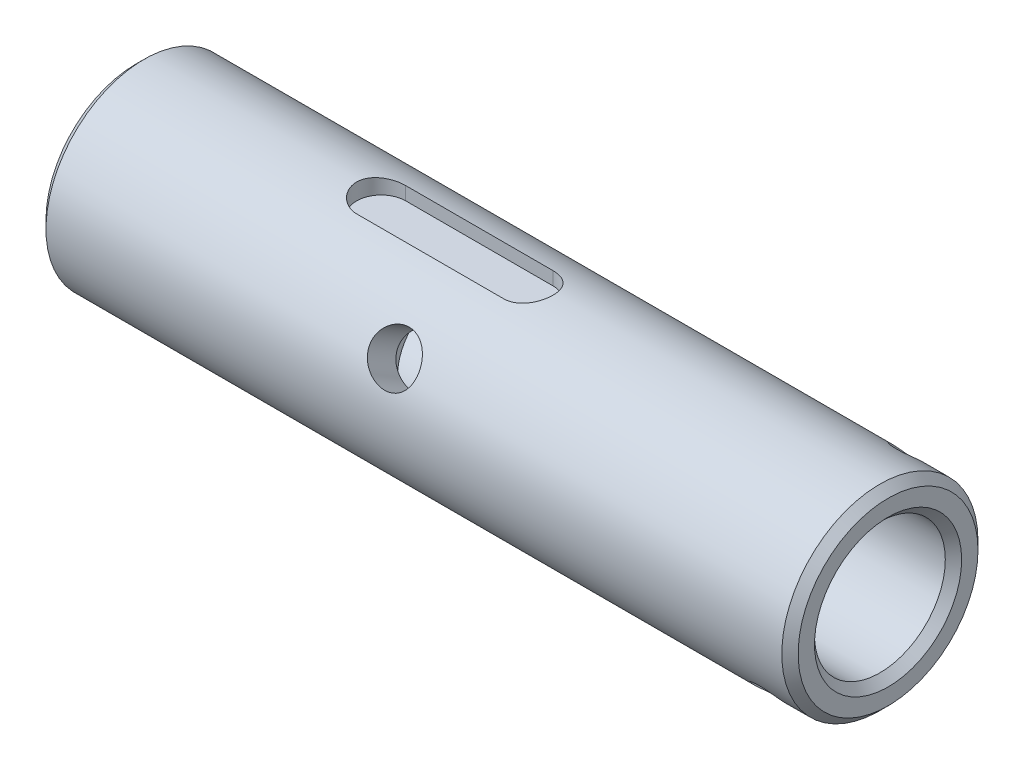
ISO-10303-21;
HEADER;
FILE_DESCRIPTION(('STEP AP214'),'2;1');
FILE_NAME('part.step','',(''),(''),'','','');
FILE_SCHEMA(('AUTOMOTIVE_DESIGN { 1 0 10303 214 1 1 1 1 }'));
ENDSEC;
DATA;
#1=APPLICATION_CONTEXT('core data for automotive mechanical design processes');
#2=APPLICATION_PROTOCOL_DEFINITION('international standard','automotive_design',2000,#1);
#3=PRODUCT_CONTEXT('',#1,'mechanical');
#4=PRODUCT('Part','Part','',(#3));
#5=PRODUCT_RELATED_PRODUCT_CATEGORY('part','',(#4));
#6=PRODUCT_DEFINITION_FORMATION('','',#4);
#7=PRODUCT_DEFINITION_CONTEXT('part definition',#1,'design');
#8=PRODUCT_DEFINITION('design','',#6,#7);
#9=PRODUCT_DEFINITION_SHAPE('','',#8);
#10=(LENGTH_UNIT() NAMED_UNIT(*) SI_UNIT(.MILLI.,.METRE.));
#11=(NAMED_UNIT(*) PLANE_ANGLE_UNIT() SI_UNIT($,.RADIAN.));
#12=(NAMED_UNIT(*) SI_UNIT($,.STERADIAN.) SOLID_ANGLE_UNIT());
#13=UNCERTAINTY_MEASURE_WITH_UNIT(LENGTH_MEASURE(1.E-05),#10,'distance_accuracy_value','');
#14=(GEOMETRIC_REPRESENTATION_CONTEXT(3) GLOBAL_UNCERTAINTY_ASSIGNED_CONTEXT((#13)) GLOBAL_UNIT_ASSIGNED_CONTEXT((#10,
#11,#12)) REPRESENTATION_CONTEXT('',''));
#15=CARTESIAN_POINT('',(0.,0.,0.));
#16=DIRECTION('',(0.,0.,1.));
#17=DIRECTION('',(1.,0.,0.));
#18=AXIS2_PLACEMENT_3D('',#15,#16,#17);
#19=CARTESIAN_POINT('',(92.,0.,0.));
#20=DIRECTION('',(-1.,0.,0.));
#21=DIRECTION('',(0.,0.,1.));
#22=AXIS2_PLACEMENT_3D('',#19,#20,#21);
#23=CYLINDRICAL_SURFACE('',#22,6.);
#24=DIRECTION('',(-1.,0.,0.));
#25=VECTOR('',#24,1.);
#26=CARTESIAN_POINT('',(92.,-5.19615242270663,-3.));
#27=LINE('',#26,#25);
#28=CARTESIAN_POINT('',(12.,-5.19615242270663,-3.));
#29=VERTEX_POINT('',#28);
#30=CARTESIAN_POINT('',(0.,-5.19615242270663,-3.));
#31=VERTEX_POINT('',#30);
#32=EDGE_CURVE('E193',#29,#31,#27,.T.);
#33=ORIENTED_EDGE('',*,*,#32,.F.);
#34=CARTESIAN_POINT('',(12.,-5.19615242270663,3.));
#35=CARTESIAN_POINT('',(12.078566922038,-5.1961293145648,3.00001415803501));
#36=CARTESIAN_POINT('',(12.1571210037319,-5.19793375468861,2.99691410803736));
#37=CARTESIAN_POINT('',(12.3135430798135,-5.20502373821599,2.98459701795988));
#38=CARTESIAN_POINT('',(12.3914114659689,-5.21030714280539,2.97538373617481));
#39=CARTESIAN_POINT('',(12.5454570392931,-5.22414169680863,2.95102137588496));
#40=CARTESIAN_POINT('',(12.6216413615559,-5.23267394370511,2.93590662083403));
#41=CARTESIAN_POINT('',(12.7722331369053,-5.25269138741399,2.89994069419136));
#42=CARTESIAN_POINT('',(12.846640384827,-5.26417692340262,2.87908886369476));
#43=CARTESIAN_POINT('',(13.0661568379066,-5.30245457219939,2.80835626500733));
#44=CARTESIAN_POINT('',(13.2080267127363,-5.3331132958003,2.75022309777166));
#45=CARTESIAN_POINT('',(13.4801003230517,-5.40122537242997,2.61391460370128));
#46=CARTESIAN_POINT('',(13.6102855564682,-5.43868922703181,2.53570822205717));
#47=CARTESIAN_POINT('',(13.8669253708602,-5.51991036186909,2.35399051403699));
#48=CARTESIAN_POINT('',(13.9922039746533,-5.56393176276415,2.24893268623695));
#49=CARTESIAN_POINT('',(14.2242512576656,-5.65116942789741,2.01973282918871));
#50=CARTESIAN_POINT('',(14.3310149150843,-5.69438547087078,1.89558563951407));
#51=CARTESIAN_POINT('',(14.530100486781,-5.77864409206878,1.62146938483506));
#52=CARTESIAN_POINT('',(14.6209604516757,-5.81934286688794,1.47032277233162));
#53=CARTESIAN_POINT('',(14.7754222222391,-5.89052246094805,1.15247232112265));
#54=CARTESIAN_POINT('',(14.8390410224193,-5.92100964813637,0.985778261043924));
#55=CARTESIAN_POINT('',(14.9325135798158,-5.9664136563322,0.654136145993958));
#56=CARTESIAN_POINT('',(14.964448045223,-5.98228414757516,0.489908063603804));
#57=CARTESIAN_POINT('',(15.0004982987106,-6.00022748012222,0.157714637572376));
#58=CARTESIAN_POINT('',(15.0046304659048,-6.00230844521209,-0.0102484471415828));
#59=CARTESIAN_POINT('',(14.985759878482,-5.99288941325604,-0.329499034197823));
#60=CARTESIAN_POINT('',(14.9650855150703,-5.98255467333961,-0.480966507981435));
#61=CARTESIAN_POINT('',(14.9013566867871,-5.95122696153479,-0.777944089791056));
#62=CARTESIAN_POINT('',(14.8583009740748,-5.93023339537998,-0.923453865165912));
#63=CARTESIAN_POINT('',(14.7507525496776,-5.87914767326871,-1.20692716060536));
#64=CARTESIAN_POINT('',(14.6859714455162,-5.84893363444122,-1.3447583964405));
#65=CARTESIAN_POINT('',(14.5372115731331,-5.7821299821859,-1.60792837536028));
#66=CARTESIAN_POINT('',(14.4532256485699,-5.74553799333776,-1.73326243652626));
#67=CARTESIAN_POINT('',(14.2593181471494,-5.66533429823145,-1.98051331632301));
#68=CARTESIAN_POINT('',(14.1476961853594,-5.62138600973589,-2.10098933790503));
#69=CARTESIAN_POINT('',(13.9062569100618,-5.53363687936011,-2.32229726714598));
#70=CARTESIAN_POINT('',(13.7764233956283,-5.48983620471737,-2.42311149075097));
#71=CARTESIAN_POINT('',(13.4919183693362,-5.40429062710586,-2.60859235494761));
#72=CARTESIAN_POINT('',(13.336187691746,-5.36285794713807,-2.6918078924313));
#73=CARTESIAN_POINT('',(13.092160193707,-5.30909631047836,-2.79553368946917));
#74=CARTESIAN_POINT('',(13.0091265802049,-5.29258029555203,-2.82658166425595));
#75=CARTESIAN_POINT('',(12.8400983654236,-5.26296956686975,-2.88133977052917));
#76=CARTESIAN_POINT('',(12.7541049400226,-5.24987351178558,-2.90505277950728));
#77=CARTESIAN_POINT('',(12.5583043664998,-5.22495242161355,-2.94969403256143));
#78=CARTESIAN_POINT('',(12.4478527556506,-5.21423663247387,-2.96849461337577));
#79=CARTESIAN_POINT('',(12.280758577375,-5.20343267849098,-2.9873623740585));
#80=CARTESIAN_POINT('',(12.2247655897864,-5.20070956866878,-2.99209615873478));
#81=CARTESIAN_POINT('',(12.1125210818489,-5.19706722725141,-2.99841614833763));
#82=CARTESIAN_POINT('',(12.0562694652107,-5.19614873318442,-3.00000106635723));
#83=CARTESIAN_POINT('',(12.,-5.19615242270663,-3.));
#84=B_SPLINE_CURVE_WITH_KNOTS('',3,(#34,#35,#36,#37,#38,#39,#40,#41,#42,#43,#44,#45,#46,#47,#48,
#49,#50,#51,#52,#53,#54,#55,#56,#57,#58,#59,#60,#61,#62,#63,#64,#65,#66,#67,#68,#69,#70,#71,#72,
#73,#74,#75,#76,#77,#78,#79,#80,#81,#82,#83),.UNSPECIFIED.,.F.,.F.,(4,2,2,2,2,2,2,2,2,2,2,2,2,2,
2,2,2,2,2,2,2,2,2,2,4),(0.,0.235597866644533,0.471051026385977,0.70515469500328,
0.939285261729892,1.40614172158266,1.87372484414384,2.37955083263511,2.8855138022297,
3.42564136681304,3.96543147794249,4.4668071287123,4.96788737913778,5.42539395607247,
5.88292604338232,6.34678927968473,6.81082564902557,7.31868953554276,7.82700811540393,
8.36794167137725,8.63811793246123,8.90818806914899,9.2448372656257,9.41351205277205,
9.58225576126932),.UNSPECIFIED.);
#85=CARTESIAN_POINT('',(12.,-5.19615242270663,3.));
#86=VERTEX_POINT('',#85);
#87=EDGE_CURVE('E187',#86,#29,#84,.T.);
#88=ORIENTED_EDGE('',*,*,#87,.F.);
#89=DIRECTION('',(-1.,0.,0.));
#90=VECTOR('',#89,1.);
#91=CARTESIAN_POINT('',(92.,-5.19615242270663,3.));
#92=LINE('',#91,#90);
#93=CARTESIAN_POINT('',(0.,-5.19615242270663,3.));
#94=VERTEX_POINT('',#93);
#95=EDGE_CURVE('E194',#94,#86,#92,.F.);
#96=ORIENTED_EDGE('',*,*,#95,.F.);
#97=CARTESIAN_POINT('',(0.,0.,0.));
#98=DIRECTION('',(1.,0.,0.));
#99=DIRECTION('',(0.,0.,-1.));
#100=AXIS2_PLACEMENT_3D('',#97,#98,#99);
#101=CIRCLE('',#100,6.);
#102=EDGE_CURVE('E211',#31,#94,#101,.T.);
#103=ORIENTED_EDGE('',*,*,#102,.F.);
#104=EDGE_LOOP('',(#33,#88,#96,#103));
#105=FACE_BOUND('',#104,.T.);
#106=CARTESIAN_POINT('',(38.,0.,0.));
#107=DIRECTION('',(1.,0.,0.));
#108=DIRECTION('',(0.,0.,-1.));
#109=AXIS2_PLACEMENT_3D('',#106,#107,#108);
#110=CIRCLE('',#109,6.);
#111=CARTESIAN_POINT('',(38.,0.,-6.));
#112=VERTEX_POINT('',#111);
#113=EDGE_CURVE('E237',#112,#112,#110,.T.);
#114=ORIENTED_EDGE('',*,*,#113,.T.);
#115=EDGE_LOOP('',(#114));
#116=FACE_BOUND('',#115,.T.);
#117=ADVANCED_FACE('F31',(#105,#116),#23,.F.);
#118=CARTESIAN_POINT('',(92.,0.,0.));
#119=DIRECTION('',(-1.,0.,0.));
#120=DIRECTION('',(0.,0.,1.));
#121=AXIS2_PLACEMENT_3D('',#118,#119,#120);
#122=CYLINDRICAL_SURFACE('',#121,12.);
#123=CARTESIAN_POINT('',(91.,0.,0.));
#124=DIRECTION('',(1.,0.,0.));
#125=DIRECTION('',(0.,0.,-1.));
#126=AXIS2_PLACEMENT_3D('',#123,#124,#125);
#127=CIRCLE('',#126,12.);
#128=CARTESIAN_POINT('',(91.,0.,-12.));
#129=VERTEX_POINT('',#128);
#130=EDGE_CURVE('E224',#129,#129,#127,.F.);
#131=ORIENTED_EDGE('',*,*,#130,.T.);
#132=EDGE_LOOP('',(#131));
#133=FACE_BOUND('',#132,.T.);
#134=CARTESIAN_POINT('',(86.,6.95238670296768,-9.78081382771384));
#135=CARTESIAN_POINT('',(86.1115005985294,6.95239129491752,-9.78081208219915));
#136=CARTESIAN_POINT('',(86.2230620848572,6.96012884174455,-9.77532477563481));
#137=CARTESIAN_POINT('',(86.4430548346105,6.99076715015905,-9.75343609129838));
#138=CARTESIAN_POINT('',(86.5514831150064,7.01368189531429,-9.73702464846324));
#139=CARTESIAN_POINT('',(86.7619938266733,7.07368498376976,-9.69352074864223));
#140=CARTESIAN_POINT('',(86.8640814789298,7.11076148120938,-9.66643721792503));
#141=CARTESIAN_POINT('',(87.0591847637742,7.19758687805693,-9.60196093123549));
#142=CARTESIAN_POINT('',(87.1522014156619,7.24733435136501,-9.56456933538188));
#143=CARTESIAN_POINT('',(87.3274502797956,7.35809500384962,-9.47962750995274));
#144=CARTESIAN_POINT('',(87.409580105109,7.41920370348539,-9.431990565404));
#145=CARTESIAN_POINT('',(87.5598346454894,7.55014838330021,-9.32750031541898));
#146=CARTESIAN_POINT('',(87.6279585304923,7.61998488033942,-9.27064646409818));
#147=CARTESIAN_POINT('',(87.7486516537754,7.76637128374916,-9.14836665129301));
#148=CARTESIAN_POINT('',(87.8011256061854,7.84295877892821,-9.08289154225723));
#149=CARTESIAN_POINT('',(87.8884168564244,7.99986204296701,-8.94500429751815));
#150=CARTESIAN_POINT('',(87.9232353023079,8.08017756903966,-8.87259261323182));
#151=CARTESIAN_POINT('',(87.9739140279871,8.2411449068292,-8.72327149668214));
#152=CARTESIAN_POINT('',(87.9899463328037,8.3217867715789,-8.6464097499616));
#153=CARTESIAN_POINT('',(88.0031326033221,8.48164713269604,-8.48965190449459));
#154=CARTESIAN_POINT('',(88.0002878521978,8.5608657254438,-8.40975601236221));
#155=CARTESIAN_POINT('',(87.9759349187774,8.71484261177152,-8.25007299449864));
#156=CARTESIAN_POINT('',(87.9546118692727,8.78963731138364,-8.1702926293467));
#157=CARTESIAN_POINT('',(87.8941991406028,8.93371252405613,-8.01250288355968));
#158=CARTESIAN_POINT('',(87.8551089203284,9.00299286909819,-7.93449355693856));
#159=CARTESIAN_POINT('',(87.7600874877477,9.13479183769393,-7.78240073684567));
#160=CARTESIAN_POINT('',(87.704079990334,9.19727805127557,-7.70833685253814));
#161=CARTESIAN_POINT('',(87.576869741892,9.31391034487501,-7.56699961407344));
#162=CARTESIAN_POINT('',(87.5056657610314,9.36805574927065,-7.49972681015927));
#163=CARTESIAN_POINT('',(87.3490569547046,9.4676925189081,-7.37355757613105));
#164=CARTESIAN_POINT('',(87.2634903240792,9.51307092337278,-7.31477267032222));
#165=CARTESIAN_POINT('',(87.0811303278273,9.59364816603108,-7.20876979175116));
#166=CARTESIAN_POINT('',(86.9843368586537,9.62884691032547,-7.16155192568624));
#167=CARTESIAN_POINT('',(86.782086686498,9.68859721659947,-7.08051086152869));
#168=CARTESIAN_POINT('',(86.6766204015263,9.71313680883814,-7.04670272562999));
#169=CARTESIAN_POINT('',(86.4601207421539,9.75116755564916,-6.99398299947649));
#170=CARTESIAN_POINT('',(86.349087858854,9.76465968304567,-6.97507009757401));
#171=CARTESIAN_POINT('',(86.1260270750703,9.78031716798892,-6.95309847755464));
#172=CARTESIAN_POINT('',(86.0140268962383,9.78261587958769,-6.94985310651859));
#173=CARTESIAN_POINT('',(85.7909706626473,9.77621683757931,-6.95885146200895));
#174=CARTESIAN_POINT('',(85.6799145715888,9.76751950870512,-6.97109459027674));
#175=CARTESIAN_POINT('',(85.4626177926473,9.73933763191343,-7.0104119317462));
#176=CARTESIAN_POINT('',(85.3563510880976,9.71992166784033,-7.0373918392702));
#177=CARTESIAN_POINT('',(85.1508238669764,9.67060951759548,-7.10500188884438));
#178=CARTESIAN_POINT('',(85.0515637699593,9.64071270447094,-7.14563284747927));
#179=CARTESIAN_POINT('',(84.8618603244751,9.57051942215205,-7.23937880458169));
#180=CARTESIAN_POINT('',(84.7715067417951,9.53012957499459,-7.29260549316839));
#181=CARTESIAN_POINT('',(84.603109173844,9.43966969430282,-7.4093234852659));
#182=CARTESIAN_POINT('',(84.5250660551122,9.38959897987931,-7.47281551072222));
#183=CARTESIAN_POINT('',(84.382678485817,9.28000846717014,-7.60848941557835));
#184=CARTESIAN_POINT('',(84.3184849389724,9.22039581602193,-7.68075480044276));
#185=CARTESIAN_POINT('',(84.2066757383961,9.09322043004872,-7.83090081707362));
#186=CARTESIAN_POINT('',(84.1590595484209,9.02565795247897,-7.9087812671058));
#187=CARTESIAN_POINT('',(84.0819915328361,8.88436261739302,-8.06717452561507));
#188=CARTESIAN_POINT('',(84.0524607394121,8.8106582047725,-8.14767425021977));
#189=CARTESIAN_POINT('',(84.0121475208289,8.6586563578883,-8.30902799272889));
#190=CARTESIAN_POINT('',(84.0013635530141,8.58035930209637,-8.38988198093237));
#191=CARTESIAN_POINT('',(83.9988944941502,8.42231442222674,-8.54850897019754));
#192=CARTESIAN_POINT('',(84.0069797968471,8.34259563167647,-8.62630741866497));
#193=CARTESIAN_POINT('',(84.0415231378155,8.18315433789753,-8.77770326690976));
#194=CARTESIAN_POINT('',(84.0679810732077,8.10343183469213,-8.85130069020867));
#195=CARTESIAN_POINT('',(84.1384305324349,7.94656412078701,-8.99239931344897));
#196=CARTESIAN_POINT('',(84.182402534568,7.86941614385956,-9.05990719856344));
#197=CARTESIAN_POINT('',(84.2866063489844,7.72010535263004,-9.18747123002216));
#198=CARTESIAN_POINT('',(84.34683893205,7.64794277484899,-9.24752702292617));
#199=CARTESIAN_POINT('',(84.4826680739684,7.510245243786,-9.3597118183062));
#200=CARTESIAN_POINT('',(84.558432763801,7.444795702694,-9.41174211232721));
#201=CARTESIAN_POINT('',(84.7228226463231,7.32381558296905,-9.50618908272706));
#202=CARTESIAN_POINT('',(84.81145084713,7.26828733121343,-9.54860350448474));
#203=CARTESIAN_POINT('',(84.9997962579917,7.16891394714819,-9.62343915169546));
#204=CARTESIAN_POINT('',(85.0995874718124,7.12515423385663,-9.65578756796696));
#205=CARTESIAN_POINT('',(85.3068873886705,7.05165211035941,-9.70959809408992));
#206=CARTESIAN_POINT('',(85.4143882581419,7.02189569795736,-9.731071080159));
#207=CARTESIAN_POINT('',(85.6019230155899,6.98407749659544,-9.75822829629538));
#208=CARTESIAN_POINT('',(85.6808214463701,6.97221927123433,-9.76669103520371));
#209=CARTESIAN_POINT('',(85.8398027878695,6.95637229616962,-9.77798437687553));
#210=CARTESIAN_POINT('',(85.9198856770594,6.95238340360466,-9.78081508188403));
#211=CARTESIAN_POINT('',(86.,6.95238670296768,-9.78081382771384));
#212=B_SPLINE_CURVE_WITH_KNOTS('',3,(#134,#135,#136,#137,#138,#139,#140,#141,#142,#143,#144,
#145,#146,#147,#148,#149,#150,#151,#152,#153,#154,#155,#156,#157,#158,#159,#160,#161,#162,#163,
#164,#165,#166,#167,#168,#169,#170,#171,#172,#173,#174,#175,#176,#177,#178,#179,#180,#181,#182,
#183,#184,#185,#186,#187,#188,#189,#190,#191,#192,#193,#194,#195,#196,#197,#198,#199,#200,#201,
#202,#203,#204,#205,#206,#207,#208,#209,#210,#211),.UNSPECIFIED.,.T.,.F.,(4,2,2,2,2,2,2,2,2,2,2,
2,2,2,2,2,2,2,2,2,2,2,2,2,2,2,2,2,2,2,2,2,2,2,2,2,2,2,4),(0.,0.3342088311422,0.668726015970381,
1.00296399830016,1.33716437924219,1.67431327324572,2.01148214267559,2.35066384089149,
2.68982348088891,3.02585253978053,3.36185875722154,3.69453696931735,4.02722531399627,
4.3614368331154,4.69567540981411,5.03396898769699,5.37226568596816,5.71094129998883,
6.04958708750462,6.38418833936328,6.71877666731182,7.05124851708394,7.38374025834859,
7.71929874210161,8.05488083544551,8.39395290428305,8.73301400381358,9.07058387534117,
9.4081259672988,9.74158221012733,10.0750365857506,10.4081203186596,10.7412198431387,
11.078135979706,11.4151310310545,11.7545098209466,12.0935485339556,12.3336853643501,
12.5738178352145),.UNSPECIFIED.);
#213=CARTESIAN_POINT('',(86.,6.95238670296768,-9.78081382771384));
#214=VERTEX_POINT('',#213);
#215=EDGE_CURVE('E301',#214,#214,#212,.T.);
#216=ORIENTED_EDGE('',*,*,#215,.T.);
#217=EDGE_LOOP('',(#216));
#218=FACE_BOUND('',#217,.T.);
#219=CARTESIAN_POINT('',(86.,-9.78081382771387,6.95238670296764));
#220=CARTESIAN_POINT('',(85.8884994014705,-9.78081208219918,6.95239129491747));
#221=CARTESIAN_POINT('',(85.7769379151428,-9.77532477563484,6.96012884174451));
#222=CARTESIAN_POINT('',(85.5569451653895,-9.75343609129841,6.99076715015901));
#223=CARTESIAN_POINT('',(85.4485168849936,-9.73702464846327,7.01368189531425));
#224=CARTESIAN_POINT('',(85.2380061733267,-9.69352074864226,7.07368498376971));
#225=CARTESIAN_POINT('',(85.1359185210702,-9.66643721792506,7.11076148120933));
#226=CARTESIAN_POINT('',(84.9408152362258,-9.60196093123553,7.19758687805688));
#227=CARTESIAN_POINT('',(84.8477985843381,-9.56456933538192,7.24733435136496));
#228=CARTESIAN_POINT('',(84.6725497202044,-9.47962750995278,7.35809500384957));
#229=CARTESIAN_POINT('',(84.590419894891,-9.43199056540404,7.41920370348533));
#230=CARTESIAN_POINT('',(84.4401653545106,-9.32750031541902,7.55014838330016));
#231=CARTESIAN_POINT('',(84.3720414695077,-9.27064646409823,7.61998488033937));
#232=CARTESIAN_POINT('',(84.2513483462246,-9.14836665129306,7.76637128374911));
#233=CARTESIAN_POINT('',(84.1988743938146,-9.08289154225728,7.84295877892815));
#234=CARTESIAN_POINT('',(84.1115831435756,-8.9450042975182,7.99986204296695));
#235=CARTESIAN_POINT('',(84.0767646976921,-8.87259261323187,8.08017756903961));
#236=CARTESIAN_POINT('',(84.0260859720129,-8.72327149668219,8.24114490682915));
#237=CARTESIAN_POINT('',(84.0100536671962,-8.64640974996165,8.32178677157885));
#238=CARTESIAN_POINT('',(83.9968673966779,-8.48965190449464,8.48164713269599));
#239=CARTESIAN_POINT('',(83.9997121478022,-8.40975601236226,8.56086572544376));
#240=CARTESIAN_POINT('',(84.0240650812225,-8.25007299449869,8.71484261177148));
#241=CARTESIAN_POINT('',(84.0453881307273,-8.17029262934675,8.78963731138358));
#242=CARTESIAN_POINT('',(84.1058008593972,-8.01250288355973,8.93371252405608));
#243=CARTESIAN_POINT('',(84.1448910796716,-7.93449355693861,9.00299286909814));
#244=CARTESIAN_POINT('',(84.2399125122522,-7.78240073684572,9.13479183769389));
#245=CARTESIAN_POINT('',(84.2959200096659,-7.70833685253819,9.19727805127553));
#246=CARTESIAN_POINT('',(84.423130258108,-7.56699961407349,9.31391034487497));
#247=CARTESIAN_POINT('',(84.4943342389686,-7.49972681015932,9.36805574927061));
#248=CARTESIAN_POINT('',(84.6509430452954,-7.3735575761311,9.46769251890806));
#249=CARTESIAN_POINT('',(84.7365096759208,-7.31477267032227,9.51307092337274));
#250=CARTESIAN_POINT('',(84.9188696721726,-7.20876979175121,9.59364816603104));
#251=CARTESIAN_POINT('',(85.0156631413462,-7.16155192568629,9.62884691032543));
#252=CARTESIAN_POINT('',(85.217913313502,-7.08051086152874,9.68859721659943));
#253=CARTESIAN_POINT('',(85.3233795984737,-7.04670272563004,9.7131368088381));
#254=CARTESIAN_POINT('',(85.539879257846,-6.99398299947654,9.75116755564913));
#255=CARTESIAN_POINT('',(85.6509121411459,-6.97507009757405,9.76465968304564));
#256=CARTESIAN_POINT('',(85.8739729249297,-6.95309847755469,9.78031716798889));
#257=CARTESIAN_POINT('',(85.9859731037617,-6.94985310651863,9.78261587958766));
#258=CARTESIAN_POINT('',(86.2090293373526,-6.95885146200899,9.77621683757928));
#259=CARTESIAN_POINT('',(86.3200854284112,-6.97109459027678,9.7675195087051));
#260=CARTESIAN_POINT('',(86.5373822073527,-7.01041193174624,9.7393376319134));
#261=CARTESIAN_POINT('',(86.6436489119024,-7.03739183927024,9.7199216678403));
#262=CARTESIAN_POINT('',(86.8491761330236,-7.10500188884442,9.67060951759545));
#263=CARTESIAN_POINT('',(86.9484362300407,-7.14563284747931,9.64071270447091));
#264=CARTESIAN_POINT('',(87.1381396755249,-7.23937880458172,9.57051942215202));
#265=CARTESIAN_POINT('',(87.2284932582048,-7.29260549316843,9.53012957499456));
#266=CARTESIAN_POINT('',(87.396890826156,-7.40932348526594,9.43966969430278));
#267=CARTESIAN_POINT('',(87.4749339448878,-7.47281551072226,9.38959897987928));
#268=CARTESIAN_POINT('',(87.617321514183,-7.60848941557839,9.28000846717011));
#269=CARTESIAN_POINT('',(87.6815150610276,-7.6807548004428,9.2203958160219));
#270=CARTESIAN_POINT('',(87.7933242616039,-7.83090081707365,9.0932204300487));
#271=CARTESIAN_POINT('',(87.8409404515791,-7.90878126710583,9.02565795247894));
#272=CARTESIAN_POINT('',(87.9180084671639,-8.0671745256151,8.884362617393));
#273=CARTESIAN_POINT('',(87.9475392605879,-8.1476742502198,8.81065820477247));
#274=CARTESIAN_POINT('',(87.9878524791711,-8.30902799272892,8.65865635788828));
#275=CARTESIAN_POINT('',(87.9986364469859,-8.3898819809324,8.58035930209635));
#276=CARTESIAN_POINT('',(88.0011055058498,-8.54850897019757,8.42231442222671));
#277=CARTESIAN_POINT('',(87.9930202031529,-8.62630741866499,8.34259563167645));
#278=CARTESIAN_POINT('',(87.9584768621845,-8.77770326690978,8.1831543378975));
#279=CARTESIAN_POINT('',(87.9320189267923,-8.8513006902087,8.1034318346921));
#280=CARTESIAN_POINT('',(87.8615694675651,-8.99239931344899,7.94656412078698));
#281=CARTESIAN_POINT('',(87.817597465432,-9.05990719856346,7.86941614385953));
#282=CARTESIAN_POINT('',(87.7133936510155,-9.18747123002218,7.72010535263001));
#283=CARTESIAN_POINT('',(87.65316106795,-9.24752702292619,7.64794277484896));
#284=CARTESIAN_POINT('',(87.5173319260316,-9.35971181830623,7.51024524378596));
#285=CARTESIAN_POINT('',(87.441567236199,-9.41174211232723,7.44479570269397));
#286=CARTESIAN_POINT('',(87.2771773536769,-9.50618908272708,7.32381558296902));
#287=CARTESIAN_POINT('',(87.18854915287,-9.54860350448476,7.26828733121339));
#288=CARTESIAN_POINT('',(87.0002037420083,-9.62343915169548,7.16891394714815));
#289=CARTESIAN_POINT('',(86.9004125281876,-9.65578756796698,7.12515423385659));
#290=CARTESIAN_POINT('',(86.6931126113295,-9.70959809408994,7.05165211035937));
#291=CARTESIAN_POINT('',(86.5856117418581,-9.73107108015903,7.02189569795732));
#292=CARTESIAN_POINT('',(86.3980769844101,-9.75822829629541,6.9840774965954));
#293=CARTESIAN_POINT('',(86.3191785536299,-9.76669103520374,6.97221927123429));
#294=CARTESIAN_POINT('',(86.1601972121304,-9.77798437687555,6.95637229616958));
#295=CARTESIAN_POINT('',(86.0801143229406,-9.78081508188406,6.95238340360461));
#296=CARTESIAN_POINT('',(86.,-9.78081382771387,6.95238670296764));
#297=B_SPLINE_CURVE_WITH_KNOTS('',3,(#219,#220,#221,#222,#223,#224,#225,#226,#227,#228,#229,
#230,#231,#232,#233,#234,#235,#236,#237,#238,#239,#240,#241,#242,#243,#244,#245,#246,#247,#248,
#249,#250,#251,#252,#253,#254,#255,#256,#257,#258,#259,#260,#261,#262,#263,#264,#265,#266,#267,
#268,#269,#270,#271,#272,#273,#274,#275,#276,#277,#278,#279,#280,#281,#282,#283,#284,#285,#286,
#287,#288,#289,#290,#291,#292,#293,#294,#295,#296),.UNSPECIFIED.,.T.,.F.,(4,2,2,2,2,2,2,2,2,2,2,
2,2,2,2,2,2,2,2,2,2,2,2,2,2,2,2,2,2,2,2,2,2,2,2,2,2,2,4),(0.,0.334208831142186,
0.668726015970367,1.00296399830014,1.33716437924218,1.6743132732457,2.01148214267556,
2.35066384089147,2.6898234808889,3.02585253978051,3.36185875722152,3.69453696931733,
4.02722531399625,4.36143683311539,4.6956754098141,5.03396898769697,5.37226568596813,
5.7109412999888,6.04958708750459,6.38418833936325,6.71877666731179,7.05124851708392,
7.38374025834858,7.71929874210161,8.05488083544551,8.39395290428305,8.73301400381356,
9.07058387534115,9.40812596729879,9.74158221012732,10.0750365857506,10.4081203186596,
10.7412198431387,11.078135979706,11.4151310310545,11.7545098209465,12.0935485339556,
12.3336853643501,12.5738178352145),.UNSPECIFIED.);
#298=CARTESIAN_POINT('',(86.,-9.78081382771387,6.95238670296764));
#299=VERTEX_POINT('',#298);
#300=EDGE_CURVE('E240',#299,#299,#297,.T.);
#301=ORIENTED_EDGE('',*,*,#300,.T.);
#302=EDGE_LOOP('',(#301));
#303=FACE_BOUND('',#302,.T.);
#304=CARTESIAN_POINT('',(42.,3.21139880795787,11.562305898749));
#305=CARTESIAN_POINT('',(42.1656609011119,3.21140446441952,11.5623062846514));
#306=CARTESIAN_POINT('',(42.3313738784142,3.22511350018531,11.5585234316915));
#307=CARTESIAN_POINT('',(42.6580410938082,3.27934706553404,11.5432512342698));
#308=CARTESIAN_POINT('',(42.8189925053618,3.31988720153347,11.5317574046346));
#309=CARTESIAN_POINT('',(43.1313642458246,3.42594638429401,11.5006920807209));
#310=CARTESIAN_POINT('',(43.2827965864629,3.49143318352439,11.4811310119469));
#311=CARTESIAN_POINT('',(43.5723730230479,3.64476894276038,11.4333757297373));
#312=CARTESIAN_POINT('',(43.7105165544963,3.73261885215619,11.4051811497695));
#313=CARTESIAN_POINT('',(43.9726339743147,3.92944092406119,11.3388915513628));
#314=CARTESIAN_POINT('',(44.09627232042,4.03879760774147,11.3006111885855));
#315=CARTESIAN_POINT('',(44.3229136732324,4.27369003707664,11.2138852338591));
#316=CARTESIAN_POINT('',(44.4259147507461,4.39922729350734,11.1654386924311));
#317=CARTESIAN_POINT('',(44.6097305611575,4.66420656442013,11.0573912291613));
#318=CARTESIAN_POINT('',(44.6902156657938,4.80381815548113,10.9976440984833));
#319=CARTESIAN_POINT('',(44.8245715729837,5.09080852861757,10.8677706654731));
#320=CARTESIAN_POINT('',(44.8784463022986,5.23818616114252,10.7976458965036));
#321=CARTESIAN_POINT('',(44.9569774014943,5.53283738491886,10.6496164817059));
#322=CARTESIAN_POINT('',(44.9822035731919,5.68005260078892,10.5718982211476));
#323=CARTESIAN_POINT('',(45.0045100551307,5.97268023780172,10.4093747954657));
#324=CARTESIAN_POINT('',(45.0015945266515,6.11809292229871,10.3245706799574));
#325=CARTESIAN_POINT('',(44.9681101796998,6.39964554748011,10.1523977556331));
#326=CARTESIAN_POINT('',(44.9381564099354,6.535919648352,10.0651276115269));
#327=CARTESIAN_POINT('',(44.8524344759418,6.79913935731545,9.88922533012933));
#328=CARTESIAN_POINT('',(44.7966649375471,6.92608446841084,9.80059312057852));
#329=CARTESIAN_POINT('',(44.6603969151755,7.16888714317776,9.62443654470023));
#330=CARTESIAN_POINT('',(44.5796795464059,7.28463416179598,9.53692942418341));
#331=CARTESIAN_POINT('',(44.3959731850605,7.50149354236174,9.36731421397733));
#332=CARTESIAN_POINT('',(44.2929803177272,7.60260335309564,9.28520706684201));
#333=CARTESIAN_POINT('',(44.0643495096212,7.79099469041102,9.12775443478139));
#334=CARTESIAN_POINT('',(43.9381741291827,7.87782789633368,9.05265209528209));
#335=CARTESIAN_POINT('',(43.6684800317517,8.03282636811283,8.91540514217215));
#336=CARTESIAN_POINT('',(43.5249605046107,8.10099076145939,8.85326113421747));
#337=CARTESIAN_POINT('',(43.2236519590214,8.21781225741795,8.74493958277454));
#338=CARTESIAN_POINT('',(43.0657971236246,8.26637316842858,8.69884092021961));
#339=CARTESIAN_POINT('',(42.7408974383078,8.34262706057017,8.62574021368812));
#340=CARTESIAN_POINT('',(42.5738545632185,8.37032450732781,8.59873408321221));
#341=CARTESIAN_POINT('',(42.2400485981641,8.40387438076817,8.56594627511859));
#342=CARTESIAN_POINT('',(42.0733946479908,8.41028445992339,8.55962285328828));
#343=CARTESIAN_POINT('',(41.7410136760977,8.40270216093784,8.56706628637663));
#344=CARTESIAN_POINT('',(41.5752865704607,8.38871166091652,8.58083129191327));
#345=CARTESIAN_POINT('',(41.2522628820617,8.34099895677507,8.6272128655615));
#346=CARTESIAN_POINT('',(41.094872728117,8.30760333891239,8.65951730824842));
#347=CARTESIAN_POINT('',(40.789882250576,8.22192367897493,8.74090615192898));
#348=CARTESIAN_POINT('',(40.6422830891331,8.1696373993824,8.78999254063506));
#349=CARTESIAN_POINT('',(40.3578704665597,8.04580481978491,8.90349313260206));
#350=CARTESIAN_POINT('',(40.2213253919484,7.97390081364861,8.96818913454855));
#351=CARTESIAN_POINT('',(39.9657739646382,7.81244131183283,9.10918352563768));
#352=CARTESIAN_POINT('',(39.8467705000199,7.72288291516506,9.18548382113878));
#353=CARTESIAN_POINT('',(39.6266267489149,7.52508578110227,9.34825457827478));
#354=CARTESIAN_POINT('',(39.5260079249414,7.416435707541,9.43493174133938));
#355=CARTESIAN_POINT('',(39.3492769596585,7.18410281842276,9.61301499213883));
#356=CARTESIAN_POINT('',(39.2731635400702,7.06042078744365,9.70442083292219));
#357=CARTESIAN_POINT('',(39.1482647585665,6.80166495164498,9.88748006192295));
#358=CARTESIAN_POINT('',(39.0992828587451,6.6666814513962,9.97912670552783));
#359=CARTESIAN_POINT('',(39.0294475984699,6.38797112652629,10.1597919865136));
#360=CARTESIAN_POINT('',(39.0085888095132,6.24424599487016,10.248811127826));
#361=CARTESIAN_POINT('',(38.9958972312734,5.95612823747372,10.41881788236));
#362=CARTESIAN_POINT('',(39.0032948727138,5.81185873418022,10.4999575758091));
#363=CARTESIAN_POINT('',(39.0451434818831,5.52318186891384,10.6546365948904));
#364=CARTESIAN_POINT('',(39.0795936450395,5.37877451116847,10.7281761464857));
#365=CARTESIAN_POINT('',(39.1741566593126,5.09499121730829,10.8658098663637));
#366=CARTESIAN_POINT('',(39.2341303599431,4.95559238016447,10.9299527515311));
#367=CARTESIAN_POINT('',(39.3779117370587,4.68522556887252,11.0485510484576));
#368=CARTESIAN_POINT('',(39.4617224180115,4.55425866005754,11.1030052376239));
#369=CARTESIAN_POINT('',(39.6531457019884,4.30176687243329,11.2032903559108));
#370=CARTESIAN_POINT('',(39.7612804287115,4.18054336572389,11.2488834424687));
#371=CARTESIAN_POINT('',(39.997268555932,3.95509701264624,11.3301190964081));
#372=CARTESIAN_POINT('',(40.1251269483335,3.85087848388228,11.3657591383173));
#373=CARTESIAN_POINT('',(40.3998042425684,3.66136178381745,11.4282367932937));
#374=CARTESIAN_POINT('',(40.5469323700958,3.5764528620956,11.4548977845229));
#375=CARTESIAN_POINT('',(40.8541664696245,3.43153068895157,11.4991468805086));
#376=CARTESIAN_POINT('',(41.0142628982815,3.37149932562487,11.5167415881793));
#377=CARTESIAN_POINT('',(41.3117310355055,3.28765463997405,11.5409200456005));
#378=CARTESIAN_POINT('',(41.4476794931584,3.25914069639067,11.5489562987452));
#379=CARTESIAN_POINT('',(41.7224066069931,3.22101121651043,11.5596488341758));
#380=CARTESIAN_POINT('',(41.8611850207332,3.21139406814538,11.5623055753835));
#381=CARTESIAN_POINT('',(42.,3.21139880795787,11.562305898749));
#382=B_SPLINE_CURVE_WITH_KNOTS('',3,(#304,#305,#306,#307,#308,#309,#310,#311,#312,#313,#314,
#315,#316,#317,#318,#319,#320,#321,#322,#323,#324,#325,#326,#327,#328,#329,#330,#331,#332,#333,
#334,#335,#336,#337,#338,#339,#340,#341,#342,#343,#344,#345,#346,#347,#348,#349,#350,#351,#352,
#353,#354,#355,#356,#357,#358,#359,#360,#361,#362,#363,#364,#365,#366,#367,#368,#369,#370,#371,
#372,#373,#374,#375,#376,#377,#378,#379,#380,#381),.UNSPECIFIED.,.T.,.F.,(4,2,2,2,2,2,2,2,2,2,2,
2,2,2,2,2,2,2,2,2,2,2,2,2,2,2,2,2,2,2,2,2,2,2,2,2,2,2,4),(0.,0.496472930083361,
0.993234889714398,1.48935687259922,1.98549992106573,2.4914874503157,2.99752225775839,
3.51061795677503,4.0236379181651,4.52626501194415,5.02881778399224,5.52021915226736,
6.01164668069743,6.50751449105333,7.00346862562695,7.51284559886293,8.02224637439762,
8.53411718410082,9.04587840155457,9.54412289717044,10.042321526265,10.5323688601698,
11.0224742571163,11.5221941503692,12.0219962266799,12.5343039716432,13.046584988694,
13.5551048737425,14.0635265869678,14.5582013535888,15.0528614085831,15.5448585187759,
16.0369176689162,16.5407651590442,17.0447403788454,17.5581177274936,18.0711206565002,
18.4871739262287,18.903191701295),.UNSPECIFIED.);
#383=CARTESIAN_POINT('',(42.,3.21139880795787,11.562305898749));
#384=VERTEX_POINT('',#383);
#385=EDGE_CURVE('E133',#384,#384,#382,.T.);
#386=ORIENTED_EDGE('',*,*,#385,.F.);
#387=EDGE_LOOP('',(#386));
#388=FACE_BOUND('',#387,.T.);
#389=DIRECTION('',(-1.,0.,0.));
#390=VECTOR('',#389,1.);
#391=CARTESIAN_POINT('',(92.,-11.6189500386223,-3.));
#392=LINE('',#391,#390);
#393=CARTESIAN_POINT('',(12.,-11.6189500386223,-3.));
#394=VERTEX_POINT('',#393);
#395=CARTESIAN_POINT('',(0.999999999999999,-11.6189500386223,-3.));
#396=VERTEX_POINT('',#395);
#397=EDGE_CURVE('E168',#394,#396,#392,.T.);
#398=ORIENTED_EDGE('',*,*,#397,.T.);
#399=CARTESIAN_POINT('',(1.,0.,0.));
#400=DIRECTION('',(1.,0.,0.));
#401=DIRECTION('',(0.,0.,-1.));
#402=AXIS2_PLACEMENT_3D('',#399,#400,#401);
#403=CIRCLE('',#402,12.);
#404=CARTESIAN_POINT('',(1.,-11.6189500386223,3.));
#405=VERTEX_POINT('',#404);
#406=EDGE_CURVE('E217',#396,#405,#403,.T.);
#407=ORIENTED_EDGE('',*,*,#406,.T.);
#408=DIRECTION('',(-1.,0.,0.));
#409=VECTOR('',#408,1.);
#410=CARTESIAN_POINT('',(92.,-11.6189500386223,3.));
#411=LINE('',#410,#409);
#412=CARTESIAN_POINT('',(12.,-11.6189500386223,3.));
#413=VERTEX_POINT('',#412);
#414=EDGE_CURVE('E152',#405,#413,#411,.F.);
#415=ORIENTED_EDGE('',*,*,#414,.T.);
#416=CARTESIAN_POINT('',(12.,-11.6189500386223,3.));
#417=CARTESIAN_POINT('',(12.0829653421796,-11.6189407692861,3.00000961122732));
#418=CARTESIAN_POINT('',(12.165924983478,-11.6198384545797,2.99655852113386));
#419=CARTESIAN_POINT('',(12.331223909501,-11.623378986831,2.98280958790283));
#420=CARTESIAN_POINT('',(12.4135632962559,-11.6260215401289,2.9725128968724));
#421=CARTESIAN_POINT('',(12.5768795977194,-11.632976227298,2.94517439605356));
#422=CARTESIAN_POINT('',(12.6578588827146,-11.6372850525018,2.92814595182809));
#423=CARTESIAN_POINT('',(12.8180265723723,-11.6474360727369,2.88750208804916));
#424=CARTESIAN_POINT('',(12.8972149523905,-11.6532782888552,2.8638865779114));
#425=CARTESIAN_POINT('',(13.1312520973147,-11.67286043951,2.78341859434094));
#426=CARTESIAN_POINT('',(13.2827369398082,-11.6886633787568,2.71691695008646));
#427=CARTESIAN_POINT('',(13.5723670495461,-11.7239746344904,2.56023959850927));
#428=CARTESIAN_POINT('',(13.7105087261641,-11.7434839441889,2.4700575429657));
#429=CARTESIAN_POINT('',(13.9726226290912,-11.7844877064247,2.26645521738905));
#430=CARTESIAN_POINT('',(14.0962622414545,-11.806013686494,2.1526122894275));
#431=CARTESIAN_POINT('',(14.3229086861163,-11.8483531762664,1.90582685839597));
#432=CARTESIAN_POINT('',(14.4259122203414,-11.8691665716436,1.7728813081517));
#433=CARTESIAN_POINT('',(14.6097323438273,-11.9080854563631,1.48937083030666));
#434=CARTESIAN_POINT('',(14.6902195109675,-11.926149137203,1.33858605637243));
#435=CARTESIAN_POINT('',(14.8245743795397,-11.9571703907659,1.02510773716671));
#436=CARTESIAN_POINT('',(14.8784473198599,-11.9701289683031,0.862416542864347));
#437=CARTESIAN_POINT('',(14.9569769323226,-11.9892569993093,0.533232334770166));
#438=CARTESIAN_POINT('',(14.9822030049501,-11.9955585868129,0.366882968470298));
#439=CARTESIAN_POINT('',(15.0045101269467,-12.0011231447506,0.0321983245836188));
#440=CARTESIAN_POINT('',(15.001594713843,-12.0003869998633,-0.136136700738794));
#441=CARTESIAN_POINT('',(14.9681101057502,-11.9920571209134,-0.466057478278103));
#442=CARTESIAN_POINT('',(14.9381561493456,-11.984615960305,-0.627710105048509));
#443=CARTESIAN_POINT('',(14.8524339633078,-11.9638899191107,-0.943616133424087));
#444=CARTESIAN_POINT('',(14.7966645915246,-11.9506047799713,-1.097869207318));
#445=CARTESIAN_POINT('',(14.6603961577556,-11.9194499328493,-1.39622185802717));
#446=CARTESIAN_POINT('',(14.5796778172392,-11.901539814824,-1.54021688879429));
#447=CARTESIAN_POINT('',(14.3959706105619,-11.8630783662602,-1.81282989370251));
#448=CARTESIAN_POINT('',(14.2929783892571,-11.8425266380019,-1.94144554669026));
#449=CARTESIAN_POINT('',(14.0643632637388,-11.8003669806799,-2.18330816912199));
#450=CARTESIAN_POINT('',(13.9382050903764,-11.7787455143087,-2.2960473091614));
#451=CARTESIAN_POINT('',(13.6685103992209,-11.7373850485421,-2.49890872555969));
#452=CARTESIAN_POINT('',(13.5249691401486,-11.7176465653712,-2.58902481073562));
#453=CARTESIAN_POINT('',(13.2235632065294,-11.6822344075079,-2.74441412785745));
#454=CARTESIAN_POINT('',(13.0656256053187,-11.666583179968,-2.80955105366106));
#455=CARTESIAN_POINT('',(12.7406492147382,-11.6414117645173,-2.91210705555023));
#456=CARTESIAN_POINT('',(12.5736244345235,-11.6318824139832,-2.94956756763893));
#457=CARTESIAN_POINT('',(12.3376278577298,-11.6236587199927,-2.98171390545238));
#458=CARTESIAN_POINT('',(12.2702408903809,-11.6218956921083,-2.98857237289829));
#459=CARTESIAN_POINT('',(12.1352466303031,-11.6195418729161,-2.99771027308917));
#460=CARTESIAN_POINT('',(12.0676398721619,-11.6189491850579,-2.99999711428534));
#461=CARTESIAN_POINT('',(12.,-11.6189500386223,-3.));
#462=B_SPLINE_CURVE_WITH_KNOTS('',3,(#416,#417,#418,#419,#420,#421,#422,#423,#424,#425,#426,
#427,#428,#429,#430,#431,#432,#433,#434,#435,#436,#437,#438,#439,#440,#441,#442,#443,#444,#445,
#446,#447,#448,#449,#450,#451,#452,#453,#454,#455,#456,#457,#458,#459,#460,#461),.UNSPECIFIED.,
.F.,.F.,(4,2,2,2,2,2,2,2,2,2,2,2,2,2,2,2,2,2,2,2,2,2,4),(0.,0.248809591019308,0.497577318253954,
0.745853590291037,0.994133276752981,1.49019923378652,1.98639831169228,2.49236907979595,
2.99842064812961,3.51152900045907,4.02453630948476,4.52715783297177,5.0297161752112,
5.5211197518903,6.01254507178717,6.50841867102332,7.00436701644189,7.51368627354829,
8.02314476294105,8.53534499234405,9.0467768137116,9.24991884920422,9.45273141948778),.UNSPECIFIED.);
#463=EDGE_CURVE('E161',#413,#394,#462,.T.);
#464=ORIENTED_EDGE('',*,*,#463,.T.);
#465=EDGE_LOOP('',(#398,#407,#415,#464));
#466=FACE_BOUND('',#465,.T.);
#467=DIRECTION('',(-1.,0.,0.));
#468=VECTOR('',#467,1.);
#469=CARTESIAN_POINT('',(92.,11.6189500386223,3.));
#470=LINE('',#469,#468);
#471=CARTESIAN_POINT('',(48.,11.6189500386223,3.));
#472=VERTEX_POINT('',#471);
#473=CARTESIAN_POINT('',(30.,11.6189500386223,3.));
#474=VERTEX_POINT('',#473);
#475=EDGE_CURVE('E236',#472,#474,#470,.T.);
#476=ORIENTED_EDGE('',*,*,#475,.T.);
#477=CARTESIAN_POINT('',(30.,11.6189500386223,3.));
#478=CARTESIAN_POINT('',(29.9170346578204,11.6189407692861,3.00000961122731));
#479=CARTESIAN_POINT('',(29.834075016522,11.6198384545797,2.99655852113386));
#480=CARTESIAN_POINT('',(29.668776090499,11.623378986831,2.98280958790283));
#481=CARTESIAN_POINT('',(29.5864367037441,11.6260215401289,2.97251289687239));
#482=CARTESIAN_POINT('',(29.4231204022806,11.632976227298,2.94517439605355));
#483=CARTESIAN_POINT('',(29.3421411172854,11.6372850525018,2.92814595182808));
#484=CARTESIAN_POINT('',(29.1819734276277,11.6474360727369,2.88750208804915));
#485=CARTESIAN_POINT('',(29.1027850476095,11.6532782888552,2.86388657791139));
#486=CARTESIAN_POINT('',(28.8687479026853,11.67286043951,2.78341859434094));
#487=CARTESIAN_POINT('',(28.7172630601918,11.6886633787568,2.71691695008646));
#488=CARTESIAN_POINT('',(28.4276329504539,11.7239746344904,2.56023959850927));
#489=CARTESIAN_POINT('',(28.2894912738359,11.7434839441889,2.4700575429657));
#490=CARTESIAN_POINT('',(28.0273773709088,11.7844877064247,2.26645521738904));
#491=CARTESIAN_POINT('',(27.9037377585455,11.806013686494,2.1526122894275));
#492=CARTESIAN_POINT('',(27.6770913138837,11.8483531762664,1.90582685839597));
#493=CARTESIAN_POINT('',(27.5740877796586,11.8691665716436,1.7728813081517));
#494=CARTESIAN_POINT('',(27.3902676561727,11.9080854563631,1.48937083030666));
#495=CARTESIAN_POINT('',(27.3097804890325,11.926149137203,1.33858605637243));
#496=CARTESIAN_POINT('',(27.1754256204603,11.9571703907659,1.02510773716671));
#497=CARTESIAN_POINT('',(27.1215526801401,11.9701289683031,0.862416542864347));
#498=CARTESIAN_POINT('',(27.0430230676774,11.9892569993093,0.533232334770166));
#499=CARTESIAN_POINT('',(27.0177969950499,11.9955585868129,0.366882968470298));
#500=CARTESIAN_POINT('',(26.9954898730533,12.0011231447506,0.0321983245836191));
#501=CARTESIAN_POINT('',(26.998405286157,12.0003869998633,-0.136136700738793));
#502=CARTESIAN_POINT('',(27.0318898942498,11.9920571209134,-0.466057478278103));
#503=CARTESIAN_POINT('',(27.0618438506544,11.984615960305,-0.627710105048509));
#504=CARTESIAN_POINT('',(27.1475660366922,11.9638899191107,-0.943616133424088));
#505=CARTESIAN_POINT('',(27.2033354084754,11.9506047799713,-1.097869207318));
#506=CARTESIAN_POINT('',(27.3396038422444,11.9194499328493,-1.39622185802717));
#507=CARTESIAN_POINT('',(27.4203221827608,11.901539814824,-1.54021688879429));
#508=CARTESIAN_POINT('',(27.6040293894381,11.8630783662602,-1.81282989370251));
#509=CARTESIAN_POINT('',(27.7070216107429,11.8425266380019,-1.94144554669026));
#510=CARTESIAN_POINT('',(27.9356367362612,11.8003669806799,-2.18330816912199));
#511=CARTESIAN_POINT('',(28.0617949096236,11.7787455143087,-2.2960473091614));
#512=CARTESIAN_POINT('',(28.3314896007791,11.7373850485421,-2.49890872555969));
#513=CARTESIAN_POINT('',(28.4750308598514,11.7176465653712,-2.58902481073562));
#514=CARTESIAN_POINT('',(28.7764367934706,11.6822344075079,-2.74441412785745));
#515=CARTESIAN_POINT('',(28.9343743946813,11.666583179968,-2.80955105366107));
#516=CARTESIAN_POINT('',(29.2593507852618,11.6414117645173,-2.91210705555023));
#517=CARTESIAN_POINT('',(29.4263755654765,11.6318824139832,-2.94956756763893));
#518=CARTESIAN_POINT('',(29.6623721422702,11.6236587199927,-2.98171390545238));
#519=CARTESIAN_POINT('',(29.7297591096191,11.6218956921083,-2.98857237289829));
#520=CARTESIAN_POINT('',(29.8647533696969,11.6195418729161,-2.99771027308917));
#521=CARTESIAN_POINT('',(29.9323601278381,11.6189491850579,-2.99999711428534));
#522=CARTESIAN_POINT('',(30.,11.6189500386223,-3.));
#523=B_SPLINE_CURVE_WITH_KNOTS('',3,(#477,#478,#479,#480,#481,#482,#483,#484,#485,#486,#487,
#488,#489,#490,#491,#492,#493,#494,#495,#496,#497,#498,#499,#500,#501,#502,#503,#504,#505,#506,
#507,#508,#509,#510,#511,#512,#513,#514,#515,#516,#517,#518,#519,#520,#521,#522),.UNSPECIFIED.,
.F.,.F.,(4,2,2,2,2,2,2,2,2,2,2,2,2,2,2,2,2,2,2,2,2,2,4),(0.,0.248809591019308,0.497577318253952,
0.745853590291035,0.994133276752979,1.49019923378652,1.98639831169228,2.49236907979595,
2.99842064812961,3.51152900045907,4.02453630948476,4.52715783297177,5.02971617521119,
5.52111975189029,6.01254507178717,6.50841867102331,7.00436701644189,7.51368627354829,
8.02314476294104,8.53534499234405,9.0467768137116,9.24991884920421,9.45273141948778),.UNSPECIFIED.);
#524=CARTESIAN_POINT('',(30.,11.6189500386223,-3.));
#525=VERTEX_POINT('',#524);
#526=EDGE_CURVE('E385',#474,#525,#523,.T.);
#527=ORIENTED_EDGE('',*,*,#526,.T.);
#528=DIRECTION('',(-1.,0.,0.));
#529=VECTOR('',#528,1.);
#530=CARTESIAN_POINT('',(92.,11.6189500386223,-3.00000000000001));
#531=LINE('',#530,#529);
#532=CARTESIAN_POINT('',(48.,11.6189500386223,-3.00000000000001));
#533=VERTEX_POINT('',#532);
#534=EDGE_CURVE('E393',#525,#533,#531,.F.);
#535=ORIENTED_EDGE('',*,*,#534,.T.);
#536=CARTESIAN_POINT('',(48.,11.6189500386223,-3.00000000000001));
#537=CARTESIAN_POINT('',(48.0829653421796,11.6189407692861,-3.00000961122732));
#538=CARTESIAN_POINT('',(48.165924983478,11.6198384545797,-2.99655852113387));
#539=CARTESIAN_POINT('',(48.331223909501,11.623378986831,-2.98280958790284));
#540=CARTESIAN_POINT('',(48.4135632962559,11.6260215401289,-2.9725128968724));
#541=CARTESIAN_POINT('',(48.5768795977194,11.632976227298,-2.94517439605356));
#542=CARTESIAN_POINT('',(48.6578588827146,11.6372850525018,-2.92814595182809));
#543=CARTESIAN_POINT('',(48.8180265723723,11.6474360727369,-2.88750208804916));
#544=CARTESIAN_POINT('',(48.8972149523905,11.6532782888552,-2.8638865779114));
#545=CARTESIAN_POINT('',(49.1312520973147,11.67286043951,-2.78341859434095));
#546=CARTESIAN_POINT('',(49.2827369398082,11.6886633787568,-2.71691695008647));
#547=CARTESIAN_POINT('',(49.5723670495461,11.7239746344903,-2.56023959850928));
#548=CARTESIAN_POINT('',(49.7105087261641,11.7434839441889,-2.47005754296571));
#549=CARTESIAN_POINT('',(49.9726226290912,11.7844877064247,-2.26645521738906));
#550=CARTESIAN_POINT('',(50.0962622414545,11.806013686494,-2.15261228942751));
#551=CARTESIAN_POINT('',(50.3229086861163,11.8483531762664,-1.90582685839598));
#552=CARTESIAN_POINT('',(50.4259122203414,11.8691665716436,-1.77288130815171));
#553=CARTESIAN_POINT('',(50.6097323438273,11.9080854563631,-1.48937083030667));
#554=CARTESIAN_POINT('',(50.6902195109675,11.926149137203,-1.33858605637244));
#555=CARTESIAN_POINT('',(50.8245743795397,11.9571703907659,-1.02510773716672));
#556=CARTESIAN_POINT('',(50.8784473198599,11.9701289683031,-0.862416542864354));
#557=CARTESIAN_POINT('',(50.9569769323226,11.9892569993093,-0.533232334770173));
#558=CARTESIAN_POINT('',(50.9822030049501,11.9955585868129,-0.366882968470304));
#559=CARTESIAN_POINT('',(51.0045101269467,12.0011231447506,-0.0321983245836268));
#560=CARTESIAN_POINT('',(51.001594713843,12.0003869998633,0.136136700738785));
#561=CARTESIAN_POINT('',(50.9681101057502,11.9920571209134,0.466057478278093));
#562=CARTESIAN_POINT('',(50.9381561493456,11.984615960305,0.627710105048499));
#563=CARTESIAN_POINT('',(50.8524339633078,11.9638899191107,0.943616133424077));
#564=CARTESIAN_POINT('',(50.7966645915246,11.9506047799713,1.09786920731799));
#565=CARTESIAN_POINT('',(50.6603961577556,11.9194499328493,1.39622185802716));
#566=CARTESIAN_POINT('',(50.5796778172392,11.901539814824,1.54021688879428));
#567=CARTESIAN_POINT('',(50.3959706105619,11.8630783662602,1.8128298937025));
#568=CARTESIAN_POINT('',(50.2929783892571,11.8425266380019,1.94144554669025));
#569=CARTESIAN_POINT('',(50.0643632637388,11.8003669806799,2.18330816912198));
#570=CARTESIAN_POINT('',(49.9382050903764,11.7787455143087,2.2960473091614));
#571=CARTESIAN_POINT('',(49.6685103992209,11.7373850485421,2.49890872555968));
#572=CARTESIAN_POINT('',(49.5249691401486,11.7176465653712,2.58902481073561));
#573=CARTESIAN_POINT('',(49.2235632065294,11.6822344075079,2.74441412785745));
#574=CARTESIAN_POINT('',(49.0656256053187,11.666583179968,2.80955105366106));
#575=CARTESIAN_POINT('',(48.7406492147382,11.6414117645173,2.91210705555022));
#576=CARTESIAN_POINT('',(48.5736244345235,11.6318824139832,2.94956756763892));
#577=CARTESIAN_POINT('',(48.3376278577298,11.6236587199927,2.98171390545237));
#578=CARTESIAN_POINT('',(48.2702408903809,11.6218956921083,2.98857237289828));
#579=CARTESIAN_POINT('',(48.135246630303,11.6195418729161,2.99771027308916));
#580=CARTESIAN_POINT('',(48.0676398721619,11.6189491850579,2.99999711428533));
#581=CARTESIAN_POINT('',(48.,11.6189500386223,2.99999999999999));
#582=B_SPLINE_CURVE_WITH_KNOTS('',3,(#536,#537,#538,#539,#540,#541,#542,#543,#544,#545,#546,
#547,#548,#549,#550,#551,#552,#553,#554,#555,#556,#557,#558,#559,#560,#561,#562,#563,#564,#565,
#566,#567,#568,#569,#570,#571,#572,#573,#574,#575,#576,#577,#578,#579,#580,#581),.UNSPECIFIED.,
.F.,.F.,(4,2,2,2,2,2,2,2,2,2,2,2,2,2,2,2,2,2,2,2,2,2,4),(0.,0.248809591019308,0.497577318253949,
0.745853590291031,0.994133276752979,1.49019923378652,1.98639831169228,2.49236907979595,
2.9984206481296,3.51152900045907,4.02453630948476,4.52715783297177,5.02971617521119,
5.52111975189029,6.01254507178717,6.50841867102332,7.00436701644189,7.51368627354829,
8.02314476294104,8.53534499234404,9.0467768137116,9.24991884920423,9.45273141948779),.UNSPECIFIED.);
#583=EDGE_CURVE('E113',#533,#472,#582,.T.);
#584=ORIENTED_EDGE('',*,*,#583,.T.);
#585=EDGE_LOOP('',(#476,#527,#535,#584));
#586=FACE_BOUND('',#585,.T.);
#587=CARTESIAN_POINT('',(42.,-11.6189500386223,-3.));
#588=CARTESIAN_POINT('',(41.8343390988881,-11.6189532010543,-2.99999529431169));
#589=CARTESIAN_POINT('',(41.6686261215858,-11.6225316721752,-2.98623149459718));
#590=CARTESIAN_POINT('',(41.3419589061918,-11.6364223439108,-2.93162775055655));
#591=CARTESIAN_POINT('',(41.1810074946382,-11.6467384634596,-2.89077204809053));
#592=CARTESIAN_POINT('',(40.8686357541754,-11.6728646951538,-2.78338943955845));
#593=CARTESIAN_POINT('',(40.7172034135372,-11.6886677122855,-2.71689567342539));
#594=CARTESIAN_POINT('',(40.4276269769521,-11.7239783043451,-2.56022536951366));
#595=CARTESIAN_POINT('',(40.2894834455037,-11.7434860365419,-2.47004782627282));
#596=CARTESIAN_POINT('',(40.0273660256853,-11.7844885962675,-2.26645011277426));
#597=CARTESIAN_POINT('',(39.9037276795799,-11.8060151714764,-2.15260426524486));
#598=CARTESIAN_POINT('',(39.6770863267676,-11.8483545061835,-1.9058184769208));
#599=CARTESIAN_POINT('',(39.5740852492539,-11.8691671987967,-1.77287675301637));
#600=CARTESIAN_POINT('',(39.3902694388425,-11.908084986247,-1.48937424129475));
#601=CARTESIAN_POINT('',(39.3097843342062,-11.9261482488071,-1.33859349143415));
#602=CARTESIAN_POINT('',(39.1754284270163,-11.9571697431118,-1.02511582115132));
#603=CARTESIAN_POINT('',(39.1215536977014,-11.9701287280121,-0.862420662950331));
#604=CARTESIAN_POINT('',(39.0430225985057,-11.9892571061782,-0.533230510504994));
#605=CARTESIAN_POINT('',(39.0177964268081,-11.9955587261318,-0.366879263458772));
#606=CARTESIAN_POINT('',(38.9954899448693,-12.0011231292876,-0.0321945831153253));
#607=CARTESIAN_POINT('',(38.9984054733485,-12.0003869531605,0.13613855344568));
#608=CARTESIAN_POINT('',(39.0318898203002,-11.9920571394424,0.466056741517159));
#609=CARTESIAN_POINT('',(39.0618435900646,-11.9846160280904,0.627708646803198));
#610=CARTESIAN_POINT('',(39.1475655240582,-11.9638900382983,0.943614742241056));
#611=CARTESIAN_POINT('',(39.2033350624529,-11.9506048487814,1.09786853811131));
#612=CARTESIAN_POINT('',(39.3396030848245,-11.9194501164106,1.39622011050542));
#613=CARTESIAN_POINT('',(39.4203204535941,-11.9015402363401,1.54021352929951));
#614=CARTESIAN_POINT('',(39.6040268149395,-11.8630788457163,1.81282686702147));
#615=CARTESIAN_POINT('',(39.7070196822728,-11.8425268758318,1.94144410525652));
#616=CARTESIAN_POINT('',(39.9356504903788,-11.8003645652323,2.18332210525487));
#617=CARTESIAN_POINT('',(40.0618258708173,-11.7787406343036,2.29607303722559));
#618=CARTESIAN_POINT('',(40.3315199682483,-11.7373805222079,2.49892912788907));
#619=CARTESIAN_POINT('',(40.4750394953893,-11.7176444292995,2.58903322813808));
#620=CARTESIAN_POINT('',(40.7763480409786,-11.6822459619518,2.74436438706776));
#621=CARTESIAN_POINT('',(40.9342028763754,-11.6666038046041,2.80946870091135));
#622=CARTESIAN_POINT('',(41.2591025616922,-11.641423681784,2.91205686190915));
#623=CARTESIAN_POINT('',(41.4261454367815,-11.6318844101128,2.94954661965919));
#624=CARTESIAN_POINT('',(41.7599514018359,-11.6202642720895,2.99499556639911));
#625=CARTESIAN_POINT('',(41.9266053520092,-11.6179930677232,3.00370856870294));
#626=CARTESIAN_POINT('',(42.2589863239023,-11.6206481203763,2.99342038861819));
#627=CARTESIAN_POINT('',(42.4247134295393,-11.6255737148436,2.97442175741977));
#628=CARTESIAN_POINT('',(42.7477371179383,-11.6418849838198,2.90991055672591));
#629=CARTESIAN_POINT('',(42.905127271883,-11.6531636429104,2.86483688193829));
#630=CARTESIAN_POINT('',(43.210117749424,-11.6808086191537,2.74994169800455));
#631=CARTESIAN_POINT('',(43.3577169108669,-11.6971755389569,2.680117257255));
#632=CARTESIAN_POINT('',(43.6421295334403,-11.7335536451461,2.51612480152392));
#633=CARTESIAN_POINT('',(43.7786746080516,-11.7536300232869,2.42150610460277));
#634=CARTESIAN_POINT('',(44.0342260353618,-11.7950049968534,2.21118087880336));
#635=CARTESIAN_POINT('',(44.1532294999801,-11.8163037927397,2.09547088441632));
#636=CARTESIAN_POINT('',(44.3733732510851,-11.8583688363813,1.84278816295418));
#637=CARTESIAN_POINT('',(44.4739920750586,-11.8791084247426,1.70535585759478));
#638=CARTESIAN_POINT('',(44.6507230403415,-11.9171665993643,1.41510804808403));
#639=CARTESIAN_POINT('',(44.7268364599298,-11.9344853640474,1.26229334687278));
#640=CARTESIAN_POINT('',(44.8517352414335,-11.9636413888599,0.946674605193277));
#641=CARTESIAN_POINT('',(44.9007171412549,-11.9755179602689,0.783952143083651));
#642=CARTESIAN_POINT('',(44.9705524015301,-11.9926235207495,0.452249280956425));
#643=CARTESIAN_POINT('',(44.9914111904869,-11.9978537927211,0.283270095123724));
#644=CARTESIAN_POINT('',(45.0041027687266,-12.0010250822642,-0.051250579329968));
#645=CARTESIAN_POINT('',(44.9967051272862,-11.9991593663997,-0.216761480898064));
#646=CARTESIAN_POINT('',(44.954856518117,-11.9887768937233,-0.544102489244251));
#647=CARTESIAN_POINT('',(44.9204063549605,-11.9802603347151,-0.705932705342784));
#648=CARTESIAN_POINT('',(44.8258433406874,-11.9575629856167,-1.02051310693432));
#649=CARTESIAN_POINT('',(44.7658696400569,-11.9434129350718,-1.17330748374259));
#650=CARTESIAN_POINT('',(44.6220882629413,-11.9109386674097,-1.46675115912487));
#651=CARTESIAN_POINT('',(44.5382775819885,-11.8926139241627,-1.6073989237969));
#652=CARTESIAN_POINT('',(44.3468542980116,-11.8532174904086,-1.87620578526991));
#653=CARTESIAN_POINT('',(44.2387195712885,-11.8320905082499,-2.00398496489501));
#654=CARTESIAN_POINT('',(44.002731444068,-11.7897194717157,-2.23984506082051));
#655=CARTESIAN_POINT('',(43.8748730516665,-11.7684753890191,-2.34792097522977));
#656=CARTESIAN_POINT('',(43.6001957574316,-11.7278242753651,-2.54328607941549));
#657=CARTESIAN_POINT('',(43.4530676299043,-11.7084589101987,-2.63014985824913));
#658=CARTESIAN_POINT('',(43.1458335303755,-11.6743186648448,-2.77778068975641));
#659=CARTESIAN_POINT('',(42.9857371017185,-11.6595404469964,-2.83856672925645));
#660=CARTESIAN_POINT('',(42.6882689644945,-11.6385572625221,-2.92326758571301));
#661=CARTESIAN_POINT('',(42.5523205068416,-11.631259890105,-2.95197951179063));
#662=CARTESIAN_POINT('',(42.2775933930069,-11.6214551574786,-2.99034687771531));
#663=CARTESIAN_POINT('',(42.1388149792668,-11.6189473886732,-3.00000394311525));
#664=CARTESIAN_POINT('',(42.,-11.6189500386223,-3.));
#665=B_SPLINE_CURVE_WITH_KNOTS('',3,(#587,#588,#589,#590,#591,#592,#593,#594,#595,#596,#597,
#598,#599,#600,#601,#602,#603,#604,#605,#606,#607,#608,#609,#610,#611,#612,#613,#614,#615,#616,
#617,#618,#619,#620,#621,#622,#623,#624,#625,#626,#627,#628,#629,#630,#631,#632,#633,#634,#635,
#636,#637,#638,#639,#640,#641,#642,#643,#644,#645,#646,#647,#648,#649,#650,#651,#652,#653,#654,
#655,#656,#657,#658,#659,#660,#661,#662,#663,#664),.UNSPECIFIED.,.T.,.F.,(4,2,2,2,2,2,2,2,2,2,2,
2,2,2,2,2,2,2,2,2,2,2,2,2,2,2,2,2,2,2,2,2,2,2,2,2,2,2,4),(0.,0.496472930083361,
0.993234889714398,1.48935687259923,1.98549992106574,2.49148745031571,2.99752225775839,
3.51061795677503,4.02363791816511,4.52626501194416,5.02881778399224,5.52021915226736,
6.01164668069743,6.50751449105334,7.00346862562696,7.51284559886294,8.02224637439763,
8.53411718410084,9.04587840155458,9.54412289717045,10.042321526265,10.5323688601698,
11.0224742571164,11.5221941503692,12.0219962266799,12.5343039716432,13.046584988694,
13.5551048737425,14.0635265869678,14.5582013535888,15.0528614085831,15.5448585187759,
16.0369176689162,16.5407651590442,17.0447403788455,17.5581177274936,18.0711206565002,
18.4871739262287,18.903191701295),.UNSPECIFIED.);
#666=CARTESIAN_POINT('',(42.,-11.6189500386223,-3.));
#667=VERTEX_POINT('',#666);
#668=EDGE_CURVE('E130',#667,#667,#665,.T.);
#669=ORIENTED_EDGE('',*,*,#668,.T.);
#670=EDGE_LOOP('',(#669));
#671=FACE_BOUND('',#670,.T.);
#672=CARTESIAN_POINT('',(42.,3.21139880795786,-11.562305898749));
#673=CARTESIAN_POINT('',(41.8343390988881,3.21140446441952,-11.5623062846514));
#674=CARTESIAN_POINT('',(41.6686261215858,3.22511350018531,-11.5585234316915));
#675=CARTESIAN_POINT('',(41.3419589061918,3.27934706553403,-11.5432512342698));
#676=CARTESIAN_POINT('',(41.1810074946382,3.31988720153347,-11.5317574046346));
#677=CARTESIAN_POINT('',(40.8686357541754,3.42594638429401,-11.5006920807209));
#678=CARTESIAN_POINT('',(40.7172034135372,3.49143318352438,-11.4811310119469));
#679=CARTESIAN_POINT('',(40.4276269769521,3.64476894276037,-11.4333757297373));
#680=CARTESIAN_POINT('',(40.2894834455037,3.73261885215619,-11.4051811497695));
#681=CARTESIAN_POINT('',(40.0273660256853,3.92944092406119,-11.3388915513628));
#682=CARTESIAN_POINT('',(39.9037276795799,4.03879760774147,-11.3006111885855));
#683=CARTESIAN_POINT('',(39.6770863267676,4.27369003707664,-11.2138852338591));
#684=CARTESIAN_POINT('',(39.5740852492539,4.39922729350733,-11.1654386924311));
#685=CARTESIAN_POINT('',(39.3902694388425,4.66420656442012,-11.0573912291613));
#686=CARTESIAN_POINT('',(39.3097843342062,4.80381815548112,-10.9976440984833));
#687=CARTESIAN_POINT('',(39.1754284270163,5.09080852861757,-10.8677706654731));
#688=CARTESIAN_POINT('',(39.1215536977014,5.23818616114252,-10.7976458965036));
#689=CARTESIAN_POINT('',(39.0430225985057,5.53283738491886,-10.6496164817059));
#690=CARTESIAN_POINT('',(39.0177964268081,5.68005260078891,-10.5718982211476));
#691=CARTESIAN_POINT('',(38.9954899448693,5.97268023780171,-10.4093747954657));
#692=CARTESIAN_POINT('',(38.9984054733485,6.1180929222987,-10.3245706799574));
#693=CARTESIAN_POINT('',(39.0318898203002,6.39964554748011,-10.1523977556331));
#694=CARTESIAN_POINT('',(39.0618435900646,6.53591964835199,-10.0651276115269));
#695=CARTESIAN_POINT('',(39.1475655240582,6.79913935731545,-9.88922533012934));
#696=CARTESIAN_POINT('',(39.2033350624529,6.92608446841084,-9.80059312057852));
#697=CARTESIAN_POINT('',(39.3396030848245,7.16888714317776,-9.62443654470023));
#698=CARTESIAN_POINT('',(39.4203204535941,7.28463416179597,-9.53692942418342));
#699=CARTESIAN_POINT('',(39.6040268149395,7.50149354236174,-9.36731421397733));
#700=CARTESIAN_POINT('',(39.7070196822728,7.60260335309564,-9.28520706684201));
#701=CARTESIAN_POINT('',(39.9356504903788,7.79099469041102,-9.12775443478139));
#702=CARTESIAN_POINT('',(40.0618258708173,7.87782789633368,-9.05265209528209));
#703=CARTESIAN_POINT('',(40.3315199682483,8.03282636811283,-8.91540514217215));
#704=CARTESIAN_POINT('',(40.4750394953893,8.10099076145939,-8.85326113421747));
#705=CARTESIAN_POINT('',(40.7763480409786,8.21781225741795,-8.74493958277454));
#706=CARTESIAN_POINT('',(40.9342028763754,8.26637316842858,-8.69884092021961));
#707=CARTESIAN_POINT('',(41.2591025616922,8.34262706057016,-8.62574021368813));
#708=CARTESIAN_POINT('',(41.4261454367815,8.37032450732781,-8.59873408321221));
#709=CARTESIAN_POINT('',(41.7599514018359,8.40387438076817,-8.56594627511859));
#710=CARTESIAN_POINT('',(41.9266053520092,8.41028445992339,-8.55962285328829));
#711=CARTESIAN_POINT('',(42.2589863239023,8.40270216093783,-8.56706628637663));
#712=CARTESIAN_POINT('',(42.4247134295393,8.38871166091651,-8.58083129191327));
#713=CARTESIAN_POINT('',(42.7477371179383,8.34099895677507,-8.62721286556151));
#714=CARTESIAN_POINT('',(42.905127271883,8.30760333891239,-8.65951730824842));
#715=CARTESIAN_POINT('',(43.210117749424,8.22192367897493,-8.74090615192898));
#716=CARTESIAN_POINT('',(43.3577169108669,8.1696373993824,-8.78999254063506));
#717=CARTESIAN_POINT('',(43.6421295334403,8.04580481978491,-8.90349313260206));
#718=CARTESIAN_POINT('',(43.7786746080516,7.97390081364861,-8.96818913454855));
#719=CARTESIAN_POINT('',(44.0342260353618,7.81244131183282,-9.10918352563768));
#720=CARTESIAN_POINT('',(44.1532294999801,7.72288291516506,-9.18548382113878));
#721=CARTESIAN_POINT('',(44.3733732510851,7.52508578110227,-9.34825457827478));
#722=CARTESIAN_POINT('',(44.4739920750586,7.416435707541,-9.43493174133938));
#723=CARTESIAN_POINT('',(44.6507230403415,7.18410281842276,-9.61301499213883));
#724=CARTESIAN_POINT('',(44.7268364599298,7.06042078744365,-9.70442083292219));
#725=CARTESIAN_POINT('',(44.8517352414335,6.80166495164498,-9.88748006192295));
#726=CARTESIAN_POINT('',(44.9007171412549,6.6666814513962,-9.97912670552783));
#727=CARTESIAN_POINT('',(44.9705524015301,6.38797112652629,-10.1597919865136));
#728=CARTESIAN_POINT('',(44.9914111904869,6.24424599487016,-10.248811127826));
#729=CARTESIAN_POINT('',(45.0041027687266,5.95612823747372,-10.41881788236));
#730=CARTESIAN_POINT('',(44.9967051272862,5.81185873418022,-10.4999575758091));
#731=CARTESIAN_POINT('',(44.954856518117,5.52318186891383,-10.6546365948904));
#732=CARTESIAN_POINT('',(44.9204063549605,5.37877451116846,-10.7281761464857));
#733=CARTESIAN_POINT('',(44.8258433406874,5.09499121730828,-10.8658098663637));
#734=CARTESIAN_POINT('',(44.7658696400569,4.95559238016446,-10.9299527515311));
#735=CARTESIAN_POINT('',(44.6220882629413,4.68522556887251,-11.0485510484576));
#736=CARTESIAN_POINT('',(44.5382775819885,4.55425866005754,-11.1030052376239));
#737=CARTESIAN_POINT('',(44.3468542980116,4.30176687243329,-11.2032903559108));
#738=CARTESIAN_POINT('',(44.2387195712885,4.18054336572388,-11.2488834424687));
#739=CARTESIAN_POINT('',(44.002731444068,3.95509701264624,-11.3301190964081));
#740=CARTESIAN_POINT('',(43.8748730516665,3.85087848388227,-11.3657591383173));
#741=CARTESIAN_POINT('',(43.6001957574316,3.66136178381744,-11.4282367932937));
#742=CARTESIAN_POINT('',(43.4530676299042,3.57645286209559,-11.4548977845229));
#743=CARTESIAN_POINT('',(43.1458335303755,3.43153068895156,-11.4991468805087));
#744=CARTESIAN_POINT('',(42.9857371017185,3.37149932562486,-11.5167415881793));
#745=CARTESIAN_POINT('',(42.6882689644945,3.28765463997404,-11.5409200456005));
#746=CARTESIAN_POINT('',(42.5523205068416,3.25914069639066,-11.5489562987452));
#747=CARTESIAN_POINT('',(42.2775933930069,3.22101121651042,-11.5596488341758));
#748=CARTESIAN_POINT('',(42.1388149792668,3.21139406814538,-11.5623055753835));
#749=CARTESIAN_POINT('',(42.,3.21139880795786,-11.562305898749));
#750=B_SPLINE_CURVE_WITH_KNOTS('',3,(#672,#673,#674,#675,#676,#677,#678,#679,#680,#681,#682,
#683,#684,#685,#686,#687,#688,#689,#690,#691,#692,#693,#694,#695,#696,#697,#698,#699,#700,#701,
#702,#703,#704,#705,#706,#707,#708,#709,#710,#711,#712,#713,#714,#715,#716,#717,#718,#719,#720,
#721,#722,#723,#724,#725,#726,#727,#728,#729,#730,#731,#732,#733,#734,#735,#736,#737,#738,#739,
#740,#741,#742,#743,#744,#745,#746,#747,#748,#749),.UNSPECIFIED.,.T.,.F.,(4,2,2,2,2,2,2,2,2,2,2,
2,2,2,2,2,2,2,2,2,2,2,2,2,2,2,2,2,2,2,2,2,2,2,2,2,2,2,4),(0.,0.496472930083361,
0.993234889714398,1.48935687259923,1.98549992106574,2.49148745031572,2.99752225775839,
3.51061795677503,4.02363791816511,4.52626501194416,5.02881778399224,5.52021915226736,
6.01164668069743,6.50751449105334,7.00346862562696,7.51284559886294,8.02224637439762,
8.53411718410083,9.04587840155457,9.54412289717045,10.042321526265,10.5323688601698,
11.0224742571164,11.5221941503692,12.0219962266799,12.5343039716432,13.046584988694,
13.5551048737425,14.0635265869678,14.5582013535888,15.0528614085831,15.5448585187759,
16.0369176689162,16.5407651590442,17.0447403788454,17.5581177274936,18.0711206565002,
18.4871739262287,18.903191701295),.UNSPECIFIED.);
#751=CARTESIAN_POINT('',(42.,3.21139880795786,-11.562305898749));
#752=VERTEX_POINT('',#751);
#753=EDGE_CURVE('E296',#752,#752,#750,.T.);
#754=ORIENTED_EDGE('',*,*,#753,.F.);
#755=EDGE_LOOP('',(#754));
#756=FACE_BOUND('',#755,.T.);
#757=ADVANCED_FACE('F170',(#133,#218,#303,#388,#466,#586,#671,#756),#122,.T.);
#758=CARTESIAN_POINT('',(92.,0.,0.));
#759=DIRECTION('',(1.,0.,0.));
#760=DIRECTION('',(0.,0.,-1.));
#761=AXIS2_PLACEMENT_3D('',#758,#759,#760);
#762=PLANE('',#761);
#763=CARTESIAN_POINT('',(92.,0.,0.));
#764=DIRECTION('',(1.,0.,0.));
#765=DIRECTION('',(0.,0.,-1.));
#766=AXIS2_PLACEMENT_3D('',#763,#764,#765);
#767=CIRCLE('',#766,11.);
#768=CARTESIAN_POINT('',(92.,0.,-11.));
#769=VERTEX_POINT('',#768);
#770=EDGE_CURVE('E227',#769,#769,#767,.T.);
#771=ORIENTED_EDGE('',*,*,#770,.T.);
#772=EDGE_LOOP('',(#771));
#773=FACE_BOUND('',#772,.T.);
#774=CARTESIAN_POINT('',(92.,0.,0.));
#775=DIRECTION('',(1.,0.,0.));
#776=DIRECTION('',(0.,0.,-1.));
#777=AXIS2_PLACEMENT_3D('',#774,#775,#776);
#778=CIRCLE('',#777,8.99999999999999);
#779=CARTESIAN_POINT('',(92.,0.,-8.99999999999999));
#780=VERTEX_POINT('',#779);
#781=EDGE_CURVE('E230',#780,#780,#778,.F.);
#782=ORIENTED_EDGE('',*,*,#781,.T.);
#783=EDGE_LOOP('',(#782));
#784=FACE_BOUND('',#783,.T.);
#785=ADVANCED_FACE('F200',(#773,#784),#762,.T.);
#786=CARTESIAN_POINT('',(0.,0.,0.));
#787=DIRECTION('',(1.,0.,0.));
#788=DIRECTION('',(0.,0.,-1.));
#789=AXIS2_PLACEMENT_3D('',#786,#787,#788);
#790=PLANE('',#789);
#791=DIRECTION('',(0.,1.,0.));
#792=VECTOR('',#791,1.);
#793=CARTESIAN_POINT('',(0.,-12.,3.));
#794=LINE('',#793,#792);
#795=CARTESIAN_POINT('',(0.,-10.5830052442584,3.));
#796=VERTEX_POINT('',#795);
#797=EDGE_CURVE('E145',#796,#94,#794,.T.);
#798=ORIENTED_EDGE('',*,*,#797,.F.);
#799=CARTESIAN_POINT('',(0.,0.,0.));
#800=DIRECTION('',(1.,0.,0.));
#801=DIRECTION('',(0.,0.,-1.));
#802=AXIS2_PLACEMENT_3D('',#799,#800,#801);
#803=CIRCLE('',#802,11.);
#804=CARTESIAN_POINT('',(0.,-10.5830052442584,-3.));
#805=VERTEX_POINT('',#804);
#806=EDGE_CURVE('E44',#796,#805,#803,.F.);
#807=ORIENTED_EDGE('',*,*,#806,.T.);
#808=DIRECTION('',(0.,1.,0.));
#809=VECTOR('',#808,1.);
#810=CARTESIAN_POINT('',(0.,-12.,-3.));
#811=LINE('',#810,#809);
#812=EDGE_CURVE('E150',#805,#31,#811,.T.);
#813=ORIENTED_EDGE('',*,*,#812,.T.);
#814=ORIENTED_EDGE('',*,*,#102,.T.);
#815=EDGE_LOOP('',(#798,#807,#813,#814));
#816=FACE_BOUND('',#815,.T.);
#817=ADVANCED_FACE('F202',(#816),#790,.F.);
#818=CARTESIAN_POINT('',(0.,-12.,-3.));
#819=DIRECTION('',(0.,0.,-1.));
#820=DIRECTION('',(-1.,0.,0.));
#821=AXIS2_PLACEMENT_3D('',#818,#819,#820);
#822=PLANE('',#821);
#823=ORIENTED_EDGE('',*,*,#812,.F.);
#824=CARTESIAN_POINT('',(0.,-10.5830052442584,-3.));
#825=CARTESIAN_POINT('',(0.166392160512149,-10.7559277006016,-3.));
#826=CARTESIAN_POINT('',(0.332921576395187,-10.9287176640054,-3.));
#827=CARTESIAN_POINT('',(0.666254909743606,-11.2740325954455,-3.));
#828=CARTESIAN_POINT('',(0.833058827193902,-11.4465575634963,-3.));
#829=CARTESIAN_POINT('',(1.,-11.6189500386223,-3.));
#830=B_SPLINE_CURVE_WITH_KNOTS('',3,(#824,#825,#826,#827,#828,#829),.UNSPECIFIED.,.F.,.F.,(4,2,
4),(0.,0.719927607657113,1.43985517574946),.UNSPECIFIED.);
#831=EDGE_CURVE('E11',#805,#396,#830,.T.);
#832=ORIENTED_EDGE('',*,*,#831,.T.);
#833=ORIENTED_EDGE('',*,*,#397,.F.);
#834=DIRECTION('',(0.,1.,0.));
#835=VECTOR('',#834,1.);
#836=CARTESIAN_POINT('',(12.,-12.,-3.));
#837=LINE('',#836,#835);
#838=EDGE_CURVE('E153',#394,#29,#837,.T.);
#839=ORIENTED_EDGE('',*,*,#838,.T.);
#840=ORIENTED_EDGE('',*,*,#32,.T.);
#841=EDGE_LOOP('',(#823,#832,#833,#839,#840));
#842=FACE_BOUND('',#841,.T.);
#843=ADVANCED_FACE('F179',(#842),#822,.F.);
#844=CARTESIAN_POINT('',(12.,-12.,0.));
#845=DIRECTION('',(0.,1.,0.));
#846=DIRECTION('',(0.,0.,1.));
#847=AXIS2_PLACEMENT_3D('',#844,#845,#846);
#848=CYLINDRICAL_SURFACE('',#847,3.);
#849=DIRECTION('',(0.,1.,0.));
#850=VECTOR('',#849,1.);
#851=CARTESIAN_POINT('',(12.,-12.,3.));
#852=LINE('',#851,#850);
#853=EDGE_CURVE('E156',#413,#86,#852,.T.);
#854=ORIENTED_EDGE('',*,*,#853,.T.);
#855=ORIENTED_EDGE('',*,*,#87,.T.);
#856=ORIENTED_EDGE('',*,*,#838,.F.);
#857=ORIENTED_EDGE('',*,*,#463,.F.);
#858=EDGE_LOOP('',(#854,#855,#856,#857));
#859=FACE_BOUND('',#858,.T.);
#860=ADVANCED_FACE('F174',(#859),#848,.F.);
#861=CARTESIAN_POINT('',(12.,-12.,3.));
#862=DIRECTION('',(0.,0.,1.));
#863=DIRECTION('',(1.,0.,0.));
#864=AXIS2_PLACEMENT_3D('',#861,#862,#863);
#865=PLANE('',#864);
#866=ORIENTED_EDGE('',*,*,#414,.F.);
#867=CARTESIAN_POINT('',(1.,-11.6189500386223,3.));
#868=CARTESIAN_POINT('',(0.833058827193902,-11.4465575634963,3.));
#869=CARTESIAN_POINT('',(0.666254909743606,-11.2740325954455,3.));
#870=CARTESIAN_POINT('',(0.332921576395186,-10.9287176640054,3.));
#871=CARTESIAN_POINT('',(0.166392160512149,-10.7559277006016,3.));
#872=CARTESIAN_POINT('',(0.,-10.5830052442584,3.));
#873=B_SPLINE_CURVE_WITH_KNOTS('',3,(#867,#868,#869,#870,#871,#872),.UNSPECIFIED.,.F.,.F.,(4,2,
4),(0.,0.719927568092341,1.43985517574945),.UNSPECIFIED.);
#874=EDGE_CURVE('E58',#405,#796,#873,.T.);
#875=ORIENTED_EDGE('',*,*,#874,.T.);
#876=ORIENTED_EDGE('',*,*,#797,.T.);
#877=ORIENTED_EDGE('',*,*,#95,.T.);
#878=ORIENTED_EDGE('',*,*,#853,.F.);
#879=EDGE_LOOP('',(#866,#875,#876,#877,#878));
#880=FACE_BOUND('',#879,.T.);
#881=ADVANCED_FACE('F178',(#880),#865,.F.);
#882=CARTESIAN_POINT('',(48.,10.,0.));
#883=DIRECTION('',(0.,1.,0.));
#884=DIRECTION('',(0.,0.,1.));
#885=AXIS2_PLACEMENT_3D('',#882,#883,#884);
#886=CYLINDRICAL_SURFACE('',#885,3.);
#887=DIRECTION('',(0.,1.,0.));
#888=VECTOR('',#887,1.);
#889=CARTESIAN_POINT('',(48.,10.,-3.00000000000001));
#890=LINE('',#889,#888);
#891=CARTESIAN_POINT('',(48.,10.,-3.00000000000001));
#892=VERTEX_POINT('',#891);
#893=EDGE_CURVE('E105',#892,#533,#890,.T.);
#894=ORIENTED_EDGE('',*,*,#893,.F.);
#895=CARTESIAN_POINT('',(48.,10.,0.));
#896=DIRECTION('',(0.,1.,0.));
#897=DIRECTION('',(0.,0.,-1.));
#898=AXIS2_PLACEMENT_3D('',#895,#896,#897);
#899=CIRCLE('',#898,3.);
#900=CARTESIAN_POINT('',(48.,10.,3.));
#901=VERTEX_POINT('',#900);
#902=EDGE_CURVE('E110',#901,#892,#899,.T.);
#903=ORIENTED_EDGE('',*,*,#902,.F.);
#904=DIRECTION('',(0.,1.,0.));
#905=VECTOR('',#904,1.);
#906=CARTESIAN_POINT('',(48.,10.,3.));
#907=LINE('',#906,#905);
#908=EDGE_CURVE('E143',#901,#472,#907,.T.);
#909=ORIENTED_EDGE('',*,*,#908,.T.);
#910=ORIENTED_EDGE('',*,*,#583,.F.);
#911=EDGE_LOOP('',(#894,#903,#909,#910));
#912=FACE_BOUND('',#911,.T.);
#913=ADVANCED_FACE('F107',(#912),#886,.F.);
#914=CARTESIAN_POINT('',(48.,10.,3.));
#915=DIRECTION('',(0.,0.,1.));
#916=DIRECTION('',(1.,0.,0.));
#917=AXIS2_PLACEMENT_3D('',#914,#915,#916);
#918=PLANE('',#917);
#919=ORIENTED_EDGE('',*,*,#908,.F.);
#920=DIRECTION('',(1.,0.,0.));
#921=VECTOR('',#920,1.);
#922=CARTESIAN_POINT('',(48.,10.,3.));
#923=LINE('',#922,#921);
#924=CARTESIAN_POINT('',(30.,10.,3.));
#925=VERTEX_POINT('',#924);
#926=EDGE_CURVE('E117',#925,#901,#923,.T.);
#927=ORIENTED_EDGE('',*,*,#926,.F.);
#928=DIRECTION('',(0.,1.,0.));
#929=VECTOR('',#928,1.);
#930=CARTESIAN_POINT('',(30.,10.,3.));
#931=LINE('',#930,#929);
#932=EDGE_CURVE('E146',#925,#474,#931,.T.);
#933=ORIENTED_EDGE('',*,*,#932,.T.);
#934=ORIENTED_EDGE('',*,*,#475,.F.);
#935=EDGE_LOOP('',(#919,#927,#933,#934));
#936=FACE_BOUND('',#935,.T.);
#937=ADVANCED_FACE('F376',(#936),#918,.F.);
#938=CARTESIAN_POINT('',(30.,10.,0.));
#939=DIRECTION('',(0.,1.,0.));
#940=DIRECTION('',(0.,0.,1.));
#941=AXIS2_PLACEMENT_3D('',#938,#939,#940);
#942=CYLINDRICAL_SURFACE('',#941,3.);
#943=ORIENTED_EDGE('',*,*,#932,.F.);
#944=CARTESIAN_POINT('',(30.,10.,0.));
#945=DIRECTION('',(0.,1.,0.));
#946=DIRECTION('',(0.,0.,-1.));
#947=AXIS2_PLACEMENT_3D('',#944,#945,#946);
#948=CIRCLE('',#947,3.);
#949=CARTESIAN_POINT('',(30.,10.,-3.));
#950=VERTEX_POINT('',#949);
#951=EDGE_CURVE('E126',#950,#925,#948,.T.);
#952=ORIENTED_EDGE('',*,*,#951,.F.);
#953=DIRECTION('',(0.,1.,0.));
#954=VECTOR('',#953,1.);
#955=CARTESIAN_POINT('',(30.,10.,-3.));
#956=LINE('',#955,#954);
#957=EDGE_CURVE('E116',#950,#525,#956,.T.);
#958=ORIENTED_EDGE('',*,*,#957,.T.);
#959=ORIENTED_EDGE('',*,*,#526,.F.);
#960=EDGE_LOOP('',(#943,#952,#958,#959));
#961=FACE_BOUND('',#960,.T.);
#962=ADVANCED_FACE('F379',(#961),#942,.F.);
#963=CARTESIAN_POINT('',(30.,10.,-3.));
#964=DIRECTION('',(0.,0.,-1.));
#965=DIRECTION('',(-1.,0.,0.));
#966=AXIS2_PLACEMENT_3D('',#963,#964,#965);
#967=PLANE('',#966);
#968=ORIENTED_EDGE('',*,*,#957,.F.);
#969=DIRECTION('',(-1.,0.,0.));
#970=VECTOR('',#969,1.);
#971=CARTESIAN_POINT('',(30.,10.,-3.));
#972=LINE('',#971,#970);
#973=EDGE_CURVE('E120',#892,#950,#972,.T.);
#974=ORIENTED_EDGE('',*,*,#973,.F.);
#975=ORIENTED_EDGE('',*,*,#893,.T.);
#976=ORIENTED_EDGE('',*,*,#534,.F.);
#977=EDGE_LOOP('',(#968,#974,#975,#976));
#978=FACE_BOUND('',#977,.T.);
#979=ADVANCED_FACE('F121',(#978),#967,.F.);
#980=CARTESIAN_POINT('',(48.,10.,0.));
#981=DIRECTION('',(0.,-1.,0.));
#982=DIRECTION('',(0.,0.,-1.));
#983=AXIS2_PLACEMENT_3D('',#980,#981,#982);
#984=PLANE('',#983);
#985=ORIENTED_EDGE('',*,*,#902,.T.);
#986=ORIENTED_EDGE('',*,*,#973,.T.);
#987=ORIENTED_EDGE('',*,*,#951,.T.);
#988=ORIENTED_EDGE('',*,*,#926,.T.);
#989=EDGE_LOOP('',(#985,#986,#987,#988));
#990=FACE_BOUND('',#989,.T.);
#991=ADVANCED_FACE('F128',(#990),#984,.F.);
#992=CARTESIAN_POINT('',(42.,12.001,0.));
#993=DIRECTION('',(0.,-1.,0.));
#994=DIRECTION('',(0.,0.,-1.));
#995=AXIS2_PLACEMENT_3D('',#992,#993,#994);
#996=CYLINDRICAL_SURFACE('',#995,3.);
#997=CARTESIAN_POINT('',(42.,-7.41619848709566,-3.));
#998=CARTESIAN_POINT('',(42.1620149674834,-7.41619281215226,-3.00000608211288));
#999=CARTESIAN_POINT('',(42.3239898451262,-7.42156520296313,-2.98683195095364));
#1000=CARTESIAN_POINT('',(42.6430561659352,-7.44232318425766,-2.93472375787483));
#1001=CARTESIAN_POINT('',(42.8001477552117,-7.45770847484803,-2.89579046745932));
#1002=CARTESIAN_POINT('',(43.1047507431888,-7.49650960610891,-2.79379315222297));
#1003=CARTESIAN_POINT('',(43.2522841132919,-7.51990619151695,-2.73078694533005));
#1004=CARTESIAN_POINT('',(43.5347437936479,-7.57206268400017,-2.58263713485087));
#1005=CARTESIAN_POINT('',(43.6696663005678,-7.60082420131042,-2.49748688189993));
#1006=CARTESIAN_POINT('',(43.9297806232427,-7.66207149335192,-2.30293322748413));
#1007=CARTESIAN_POINT('',(44.054257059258,-7.69466683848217,-2.19260762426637));
#1008=CARTESIAN_POINT('',(44.2834456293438,-7.75899501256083,-1.95279167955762));
#1009=CARTESIAN_POINT('',(44.3881535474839,-7.79072765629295,-1.8232972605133));
#1010=CARTESIAN_POINT('',(44.578279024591,-7.8510574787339,-1.54338931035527));
#1011=CARTESIAN_POINT('',(44.6629189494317,-7.87951122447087,-1.39241389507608));
#1012=CARTESIAN_POINT('',(44.8053023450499,-7.92876015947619,-1.07711154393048));
#1013=CARTESIAN_POINT('',(44.863055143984,-7.94955800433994,-0.912789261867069));
#1014=CARTESIAN_POINT('',(44.9475157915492,-7.98037394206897,-0.582978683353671));
#1015=CARTESIAN_POINT('',(44.9754552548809,-7.99081830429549,-0.417846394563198));
#1016=CARTESIAN_POINT('',(45.00344240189,-8.0012802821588,-0.0849287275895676));
#1017=CARTESIAN_POINT('',(45.0034991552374,-8.0013012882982,0.0828557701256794));
#1018=CARTESIAN_POINT('',(44.9764364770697,-7.99118531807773,0.407487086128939));
#1019=CARTESIAN_POINT('',(44.9506614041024,-7.98155083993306,0.564464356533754));
#1020=CARTESIAN_POINT('',(44.8749281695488,-7.95386549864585,0.871678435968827));
#1021=CARTESIAN_POINT('',(44.8249682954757,-7.93581403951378,1.02191476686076));
#1022=CARTESIAN_POINT('',(44.7016590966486,-7.89275538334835,1.31397803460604));
#1023=CARTESIAN_POINT('',(44.6279799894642,-7.86765078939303,1.45565078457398));
#1024=CARTESIAN_POINT('',(44.4596158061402,-7.81302620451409,1.72497321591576));
#1025=CARTESIAN_POINT('',(44.364923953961,-7.78350479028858,1.85261835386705));
#1026=CARTESIAN_POINT('',(44.1507454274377,-7.72105059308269,2.09818097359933));
#1027=CARTESIAN_POINT('',(44.0301321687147,-7.68801927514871,2.21509229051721));
#1028=CARTESIAN_POINT('',(43.7708140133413,-7.62364921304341,2.42740791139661));
#1029=CARTESIAN_POINT('',(43.6321045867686,-7.59231089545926,2.52280681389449));
#1030=CARTESIAN_POINT('',(43.3365610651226,-7.53425406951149,2.69131223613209));
#1031=CARTESIAN_POINT('',(43.1793930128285,-7.50765354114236,2.76387695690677));
#1032=CARTESIAN_POINT('',(42.8538075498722,-7.4634487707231,2.88112928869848));
#1033=CARTESIAN_POINT('',(42.6853964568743,-7.44583952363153,2.925832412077));
#1034=CARTESIAN_POINT('',(42.3520480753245,-7.42279194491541,2.98380383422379));
#1035=CARTESIAN_POINT('',(42.1874317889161,-7.41673570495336,2.99867042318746));
#1036=CARTESIAN_POINT('',(41.8579812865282,-7.41573079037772,3.00115771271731));
#1037=CARTESIAN_POINT('',(41.6931471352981,-7.42077934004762,2.98878522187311));
#1038=CARTESIAN_POINT('',(41.3761401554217,-7.44078763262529,2.93859467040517));
#1039=CARTESIAN_POINT('',(41.2237377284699,-7.45526552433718,2.90201236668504));
#1040=CARTESIAN_POINT('',(40.9273041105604,-7.49192974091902,2.80599549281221));
#1041=CARTESIAN_POINT('',(40.7832746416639,-7.51411764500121,2.74655624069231));
#1042=CARTESIAN_POINT('',(40.5016711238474,-7.56472486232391,2.60400584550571));
#1043=CARTESIAN_POINT('',(40.3645414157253,-7.59334657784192,2.52009090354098));
#1044=CARTESIAN_POINT('',(40.105742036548,-7.6532562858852,2.33182635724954));
#1045=CARTESIAN_POINT('',(39.9840780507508,-7.68454525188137,2.22746927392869));
#1046=CARTESIAN_POINT('',(39.7516632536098,-7.74866093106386,1.99345468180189));
#1047=CARTESIAN_POINT('',(39.6420931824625,-7.7814593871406,1.86261268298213));
#1048=CARTESIAN_POINT('',(39.4463232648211,-7.84299749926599,1.5835949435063));
#1049=CARTESIAN_POINT('',(39.3601234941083,-7.87173714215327,1.43541914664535));
#1050=CARTESIAN_POINT('',(39.2141078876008,-7.92189971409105,1.12603265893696));
#1051=CARTESIAN_POINT('',(39.1542017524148,-7.9433476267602,0.964868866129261));
#1052=CARTESIAN_POINT('',(39.0626871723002,-7.97658873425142,0.633763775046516));
#1053=CARTESIAN_POINT('',(39.0310654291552,-7.98838646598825,0.46382664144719));
#1054=CARTESIAN_POINT('',(38.9984511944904,-8.00056814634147,0.130671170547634));
#1055=CARTESIAN_POINT('',(38.995781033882,-8.00157721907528,-0.0323615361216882));
#1056=CARTESIAN_POINT('',(39.0168303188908,-7.99369779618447,-0.356453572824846));
#1057=CARTESIAN_POINT('',(39.0405465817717,-7.98481049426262,-0.517513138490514));
#1058=CARTESIAN_POINT('',(39.1125177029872,-7.95842179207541,-0.829096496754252));
#1059=CARTESIAN_POINT('',(39.1601598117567,-7.9411358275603,-0.979781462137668));
#1060=CARTESIAN_POINT('',(39.2780200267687,-7.89975567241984,-1.27103094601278));
#1061=CARTESIAN_POINT('',(39.3482424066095,-7.87566019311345,-1.41159354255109));
#1062=CARTESIAN_POINT('',(39.5126278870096,-7.8218123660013,-1.68508035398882));
#1063=CARTESIAN_POINT('',(39.6076732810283,-7.79186480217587,-1.81743509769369));
#1064=CARTESIAN_POINT('',(39.8176156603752,-7.72999015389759,-2.06483469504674));
#1065=CARTESIAN_POINT('',(39.9325197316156,-7.69806236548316,-2.17987334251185));
#1066=CARTESIAN_POINT('',(40.1861282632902,-7.63376259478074,-2.39562428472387));
#1067=CARTESIAN_POINT('',(40.3257688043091,-7.60145610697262,-2.49525999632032));
#1068=CARTESIAN_POINT('',(40.6208317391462,-7.54196650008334,-2.66969419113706));
#1069=CARTESIAN_POINT('',(40.7762557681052,-7.51478391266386,-2.74449009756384));
#1070=CARTESIAN_POINT('',(41.1059113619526,-7.46804539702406,-2.86931773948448));
#1071=CARTESIAN_POINT('',(41.2806687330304,-7.44887606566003,-2.91812005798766));
#1072=CARTESIAN_POINT('',(41.6369705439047,-7.42295988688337,-2.98344713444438));
#1073=CARTESIAN_POINT('',(41.8185104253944,-7.41620484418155,-2.99999318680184));
#1074=CARTESIAN_POINT('',(42.,-7.41619848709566,-3.));
#1075=B_SPLINE_CURVE_WITH_KNOTS('',3,(#997,#998,#999,#1000,#1001,#1002,#1003,#1004,#1005,#1006,
#1007,#1008,#1009,#1010,#1011,#1012,#1013,#1014,#1015,#1016,#1017,#1018,#1019,#1020,#1021,#1022,
#1023,#1024,#1025,#1026,#1027,#1028,#1029,#1030,#1031,#1032,#1033,#1034,#1035,#1036,#1037,#1038,
#1039,#1040,#1041,#1042,#1043,#1044,#1045,#1046,#1047,#1048,#1049,#1050,#1051,#1052,#1053,#1054,
#1055,#1056,#1057,#1058,#1059,#1060,#1061,#1062,#1063,#1064,#1065,#1066,#1067,#1068,#1069,#1070,
#1071,#1072,#1073,#1074),.UNSPECIFIED.,.T.,.F.,(4,2,2,2,2,2,2,2,2,2,2,2,2,2,2,2,2,2,2,2,2,2,2,2,
2,2,2,2,2,2,2,2,2,2,2,2,2,2,4),(0.,0.485369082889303,0.970723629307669,1.45491971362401,
1.93926135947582,2.44549304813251,2.95183257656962,3.47540144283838,3.99878852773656,
4.49960036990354,5.0002493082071,5.47612945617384,5.95204330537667,6.43488262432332,
6.91787787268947,7.42913350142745,7.94051735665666,8.46325184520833,8.98569503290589,
9.47931315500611,9.97280790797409,10.4428769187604,10.9130422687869,11.4008312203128,
11.8887989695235,12.4077003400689,12.9266033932,13.4437101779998,13.9605737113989,
14.4473144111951,14.933996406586,15.4088054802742,15.883704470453,16.3785664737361,
16.8736054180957,17.394771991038,17.9159926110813,18.460063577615,19.0037752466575),.UNSPECIFIED.);
#1076=CARTESIAN_POINT('',(42.,-7.41619848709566,-3.));
#1077=VERTEX_POINT('',#1076);
#1078=EDGE_CURVE('E241',#1077,#1077,#1075,.T.);
#1079=ORIENTED_EDGE('',*,*,#1078,.F.);
#1080=EDGE_LOOP('',(#1079));
#1081=FACE_BOUND('',#1080,.T.);
#1082=ORIENTED_EDGE('',*,*,#668,.F.);
#1083=EDGE_LOOP('',(#1082));
#1084=FACE_BOUND('',#1083,.T.);
#1085=ADVANCED_FACE('F287',(#1081,#1084),#996,.F.);
#1086=CARTESIAN_POINT('',(42.,6.52410001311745,11.3000726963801));
#1087=DIRECTION('',(0.,0.500000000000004,0.866025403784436));
#1088=DIRECTION('',(0.,-0.866025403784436,0.500000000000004));
#1089=AXIS2_PLACEMENT_3D('',#1086,#1087,#1088);
#1090=CYLINDRICAL_SURFACE('',#1089,3.);
#1091=CARTESIAN_POINT('',(42.,1.11002303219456,7.92261628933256));
#1092=CARTESIAN_POINT('',(42.1620149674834,1.1100149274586,7.92261441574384));
#1093=CARTESIAN_POINT('',(42.3239898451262,1.12411025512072,7.9206799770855));
#1094=CARTESIAN_POINT('',(42.6430561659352,1.17961626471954,7.91260281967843));
#1095=CARTESIAN_POINT('',(42.8001477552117,1.22102612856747,7.90646022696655));
#1096=CARTESIAN_POINT('',(43.1047507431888,1.3287589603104,7.88906433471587));
#1097=CARTESIAN_POINT('',(43.2522841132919,1.39502222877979,7.87782326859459));
#1098=CARTESIAN_POINT('',(43.5347437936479,1.54940197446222,7.84891721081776));
#1099=CARTESIAN_POINT('',(43.6696663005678,1.63752501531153,7.83125028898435));
#1100=CARTESIAN_POINT('',(43.9297806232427,1.83663706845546,7.78701517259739));
#1101=CARTESIAN_POINT('',(44.054257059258,1.94847951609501,7.76008076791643));
#1102=CARTESIAN_POINT('',(44.2834456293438,2.18833030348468,7.69588262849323));
#1103=CARTESIAN_POINT('',(44.3881535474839,2.31634208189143,7.65861669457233));
#1104=CARTESIAN_POINT('',(44.578279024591,2.58891438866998,7.57090987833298));
#1105=CARTESIAN_POINT('',(44.6629189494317,2.73388980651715,7.52006383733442));
#1106=CARTESIAN_POINT('',(44.8053023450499,3.03157411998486,7.40506349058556));
#1107=CARTESIAN_POINT('',(44.863055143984,3.18428031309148,7.34091381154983));
#1108=CARTESIAN_POINT('',(44.9475157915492,3.48531262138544,7.20269590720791));
#1109=CARTESIAN_POINT('',(44.9754552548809,3.63354355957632,7.12917484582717));
#1110=CARTESIAN_POINT('',(45.00344240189,3.92708970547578,6.9717763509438));
#1111=CARTESIAN_POINT('',(45.0034991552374,4.0724058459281,6.88790229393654));
#1112=CARTESIAN_POINT('',(44.9764364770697,4.34848682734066,6.71682594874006));
#1113=CARTESIAN_POINT('',(44.9506614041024,4.47961589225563,6.62999361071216));
#1114=CARTESIAN_POINT('',(44.8749281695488,4.73182841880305,6.45241036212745));
#1115=CARTESIAN_POINT('',(44.8249682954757,4.8529111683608,6.36165917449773));
#1116=CARTESIAN_POINT('',(44.7016590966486,5.08431604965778,6.17833765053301));
#1117=CARTESIAN_POINT('',(44.6279799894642,5.19445595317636,6.08576005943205));
#1118=CARTESIAN_POINT('',(44.4596158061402,5.40038372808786,5.90379256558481));
#1119=CARTESIAN_POINT('',(44.364923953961,5.49616695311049,5.81440370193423));
#1120=CARTESIAN_POINT('',(44.1507454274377,5.67760332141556,5.63753547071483));
#1121=CARTESIAN_POINT('',(44.0301321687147,5.76233583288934,5.55047385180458));
#1122=CARTESIAN_POINT('',(43.7708140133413,5.91402152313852,5.38856993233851));
#1123=CARTESIAN_POINT('',(43.6321045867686,5.98097023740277,5.31373070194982));
#1124=CARTESIAN_POINT('',(43.3365610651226,6.09787180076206,5.17919930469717));
#1125=CARTESIAN_POINT('',(43.1793930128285,6.14741442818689,5.11988021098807));
#1126=CARTESIAN_POINT('',(42.8538075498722,6.22685554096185,5.02297159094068));
#1127=CARTESIAN_POINT('',(42.6853964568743,6.25676495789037,4.9853699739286));
#1128=CARTESIAN_POINT('',(42.3520480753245,6.29544589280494,4.93642447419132));
#1129=CARTESIAN_POINT('',(42.1874317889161,6.30529261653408,4.92374632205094));
#1130=CARTESIAN_POINT('',(41.8579812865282,6.30694421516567,4.92163239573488));
#1131=CARTESIAN_POINT('',(41.6931471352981,6.29875359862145,4.93219081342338));
#1132=CARTESIAN_POINT('',(41.3761401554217,6.2652914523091,4.97461377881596));
#1133=CARTESIAN_POINT('',(41.2237377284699,6.24084919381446,5.00544315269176));
#1134=CARTESIAN_POINT('',(40.9273041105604,6.17602825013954,5.0852037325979));
#1135=CARTESIAN_POINT('',(40.783274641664,6.13564629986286,5.13413864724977));
#1136=CARTESIAN_POINT('',(40.5016711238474,6.0374976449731,5.24924098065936));
#1137=CARTESIAN_POINT('',(40.3645414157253,5.97913603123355,5.31598558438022));
#1138=CARTESIAN_POINT('',(40.105742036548,5.84604900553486,5.46200118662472));
#1139=CARTESIAN_POINT('',(39.9840780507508,5.77131760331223,5.54127676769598));
#1140=CARTESIAN_POINT('',(39.7516632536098,5.60071286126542,5.71380987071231));
#1141=CARTESIAN_POINT('',(39.6420931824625,5.50379959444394,5.80763516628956));
#1142=CARTESIAN_POINT('',(39.4463232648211,5.29293220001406,6.000437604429));
#1143=CARTESIAN_POINT('',(39.3601234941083,5.17897801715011,6.09941476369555));
#1144=CARTESIAN_POINT('',(39.2141078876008,4.9361227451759,6.29755006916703));
#1145=CARTESIAN_POINT('',(39.1542017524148,4.80727476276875,6.39670640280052));
#1146=CARTESIAN_POINT('',(39.0626871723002,4.53714989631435,6.59104659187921));
#1147=CARTESIAN_POINT('',(39.0310654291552,4.39587888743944,6.68623229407));
#1148=CARTESIAN_POINT('',(38.9984511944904,4.11344862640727,6.86335967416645));
#1149=CARTESIAN_POINT('',(38.995781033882,3.9727626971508,6.94574991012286));
#1150=CARTESIAN_POINT('',(39.0168303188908,3.68815104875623,7.10097214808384));
#1151=CARTESIAN_POINT('',(39.0405465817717,3.54422572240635,7.17380530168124));
#1152=CARTESIAN_POINT('',(39.1125177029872,3.26119226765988,7.30674369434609));
#1153=CARTESIAN_POINT('',(39.1601598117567,3.12205227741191,7.3671160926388));
#1154=CARTESIAN_POINT('',(39.2780200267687,2.84913274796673,7.47690456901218));
#1155=CARTESIAN_POINT('',(39.3482424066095,2.71535422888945,7.52631857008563));
#1156=CARTESIAN_POINT('',(39.5126278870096,2.4515837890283,7.61642838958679));
#1157=CARTESIAN_POINT('',(39.6076732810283,2.32198743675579,7.65667041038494));
#1158=CARTESIAN_POINT('',(39.8176156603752,2.07679577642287,7.72678519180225));
#1159=CARTESIAN_POINT('',(39.9325197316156,1.96120549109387,7.75665423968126));
#1160=CARTESIAN_POINT('',(40.1861282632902,1.74220980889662,7.80884447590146));
#1161=CARTESIAN_POINT('',(40.3257688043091,1.63976950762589,7.8306840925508));
#1162=CARTESIAN_POINT('',(40.6208317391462,1.45896026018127,7.8663816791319));
#1163=CARTESIAN_POINT('',(40.7762557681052,1.38059381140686,7.88023882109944));
#1164=CARTESIAN_POINT('',(41.1059113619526,1.24912064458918,7.90217590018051));
#1165=CARTESIAN_POINT('',(41.2806687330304,1.19727193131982,7.90997593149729));
#1166=CARTESIAN_POINT('',(41.6369705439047,1.12773893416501,7.92019540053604));
#1167=CARTESIAN_POINT('',(41.8185104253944,1.11003211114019,7.92261838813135));
#1168=CARTESIAN_POINT('',(42.,1.11002303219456,7.92261628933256));
#1169=B_SPLINE_CURVE_WITH_KNOTS('',3,(#1091,#1092,#1093,#1094,#1095,#1096,#1097,#1098,#1099,
#1100,#1101,#1102,#1103,#1104,#1105,#1106,#1107,#1108,#1109,#1110,#1111,#1112,#1113,#1114,#1115,
#1116,#1117,#1118,#1119,#1120,#1121,#1122,#1123,#1124,#1125,#1126,#1127,#1128,#1129,#1130,#1131,
#1132,#1133,#1134,#1135,#1136,#1137,#1138,#1139,#1140,#1141,#1142,#1143,#1144,#1145,#1146,#1147,
#1148,#1149,#1150,#1151,#1152,#1153,#1154,#1155,#1156,#1157,#1158,#1159,#1160,#1161,#1162,#1163,
#1164,#1165,#1166,#1167,#1168),.UNSPECIFIED.,.T.,.F.,(4,2,2,2,2,2,2,2,2,2,2,2,2,2,2,2,2,2,2,2,2,
2,2,2,2,2,2,2,2,2,2,2,2,2,2,2,2,2,4),(0.,0.485369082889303,0.970723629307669,1.45491971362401,
1.93926135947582,2.44549304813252,2.95183257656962,3.47540144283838,3.99878852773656,
4.49960036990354,5.0002493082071,5.47612945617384,5.95204330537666,6.43488262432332,
6.91787787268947,7.42913350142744,7.94051735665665,8.46325184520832,8.98569503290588,
9.4793131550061,9.97280790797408,10.4428769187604,10.9130422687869,11.4008312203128,
11.8887989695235,12.4077003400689,12.9266033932,13.4437101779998,13.9605737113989,
14.4473144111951,14.933996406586,15.4088054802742,15.883704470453,16.3785664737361,
16.8736054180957,17.394771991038,17.9159926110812,18.4600635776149,19.0037752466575),.UNSPECIFIED.);
#1170=CARTESIAN_POINT('',(42.,1.11002303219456,7.92261628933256));
#1171=VERTEX_POINT('',#1170);
#1172=EDGE_CURVE('E275',#1171,#1171,#1169,.T.);
#1173=ORIENTED_EDGE('',*,*,#1172,.F.);
#1174=EDGE_LOOP('',(#1173));
#1175=FACE_BOUND('',#1174,.T.);
#1176=ORIENTED_EDGE('',*,*,#385,.T.);
#1177=EDGE_LOOP('',(#1176));
#1178=FACE_BOUND('',#1177,.T.);
#1179=ADVANCED_FACE('F283',(#1175,#1178),#1090,.F.);
#1180=CARTESIAN_POINT('',(42.,2.04948936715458,-3.54981971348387));
#1181=DIRECTION('',(0.,-0.500000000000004,0.866025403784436));
#1182=DIRECTION('',(0.,-0.866025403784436,-0.500000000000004));
#1183=AXIS2_PLACEMENT_3D('',#1180,#1181,#1182);
#1184=CYLINDRICAL_SURFACE('',#1183,3.);
#1185=CARTESIAN_POINT('',(42.,1.11002303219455,-7.92261628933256));
#1186=CARTESIAN_POINT('',(41.8379850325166,1.11001492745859,-7.92261441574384));
#1187=CARTESIAN_POINT('',(41.6760101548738,1.12411025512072,-7.9206799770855));
#1188=CARTESIAN_POINT('',(41.3569438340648,1.17961626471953,-7.91260281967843));
#1189=CARTESIAN_POINT('',(41.1998522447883,1.22102612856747,-7.90646022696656));
#1190=CARTESIAN_POINT('',(40.8952492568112,1.3287589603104,-7.88906433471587));
#1191=CARTESIAN_POINT('',(40.7477158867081,1.39502222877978,-7.87782326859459));
#1192=CARTESIAN_POINT('',(40.4652562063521,1.54940197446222,-7.84891721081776));
#1193=CARTESIAN_POINT('',(40.3303336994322,1.63752501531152,-7.83125028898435));
#1194=CARTESIAN_POINT('',(40.0702193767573,1.83663706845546,-7.78701517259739));
#1195=CARTESIAN_POINT('',(39.945742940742,1.948479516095,-7.76008076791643));
#1196=CARTESIAN_POINT('',(39.7165543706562,2.18833030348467,-7.69588262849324));
#1197=CARTESIAN_POINT('',(39.6118464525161,2.31634208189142,-7.65861669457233));
#1198=CARTESIAN_POINT('',(39.421720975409,2.58891438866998,-7.57090987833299));
#1199=CARTESIAN_POINT('',(39.3370810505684,2.73388980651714,-7.52006383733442));
#1200=CARTESIAN_POINT('',(39.1946976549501,3.03157411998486,-7.40506349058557));
#1201=CARTESIAN_POINT('',(39.136944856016,3.18428031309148,-7.34091381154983));
#1202=CARTESIAN_POINT('',(39.0524842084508,3.48531262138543,-7.20269590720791));
#1203=CARTESIAN_POINT('',(39.0245447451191,3.63354355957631,-7.12917484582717));
#1204=CARTESIAN_POINT('',(38.99655759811,3.92708970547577,-6.97177635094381));
#1205=CARTESIAN_POINT('',(38.9965008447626,4.07240584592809,-6.88790229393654));
#1206=CARTESIAN_POINT('',(39.0235635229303,4.34848682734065,-6.71682594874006));
#1207=CARTESIAN_POINT('',(39.0493385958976,4.47961589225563,-6.62999361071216));
#1208=CARTESIAN_POINT('',(39.1250718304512,4.73182841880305,-6.45241036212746));
#1209=CARTESIAN_POINT('',(39.1750317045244,4.85291116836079,-6.36165917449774));
#1210=CARTESIAN_POINT('',(39.2983409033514,5.08431604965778,-6.17833765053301));
#1211=CARTESIAN_POINT('',(39.3720200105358,5.19445595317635,-6.08576005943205));
#1212=CARTESIAN_POINT('',(39.5403841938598,5.40038372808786,-5.90379256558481));
#1213=CARTESIAN_POINT('',(39.635076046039,5.49616695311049,-5.81440370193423));
#1214=CARTESIAN_POINT('',(39.8492545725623,5.67760332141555,-5.63753547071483));
#1215=CARTESIAN_POINT('',(39.9698678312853,5.76233583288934,-5.55047385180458));
#1216=CARTESIAN_POINT('',(40.2291859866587,5.91402152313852,-5.38856993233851));
#1217=CARTESIAN_POINT('',(40.3678954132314,5.98097023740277,-5.31373070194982));
#1218=CARTESIAN_POINT('',(40.6634389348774,6.09787180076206,-5.17919930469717));
#1219=CARTESIAN_POINT('',(40.8206069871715,6.14741442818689,-5.11988021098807));
#1220=CARTESIAN_POINT('',(41.1461924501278,6.22685554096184,-5.02297159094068));
#1221=CARTESIAN_POINT('',(41.3146035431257,6.25676495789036,-4.9853699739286));
#1222=CARTESIAN_POINT('',(41.6479519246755,6.29544589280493,-4.93642447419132));
#1223=CARTESIAN_POINT('',(41.8125682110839,6.30529261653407,-4.92374632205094));
#1224=CARTESIAN_POINT('',(42.1420187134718,6.30694421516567,-4.92163239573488));
#1225=CARTESIAN_POINT('',(42.3068528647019,6.29875359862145,-4.93219081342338));
#1226=CARTESIAN_POINT('',(42.6238598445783,6.2652914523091,-4.97461377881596));
#1227=CARTESIAN_POINT('',(42.7762622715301,6.24084919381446,-5.00544315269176));
#1228=CARTESIAN_POINT('',(43.0726958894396,6.17602825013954,-5.08520373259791));
#1229=CARTESIAN_POINT('',(43.2167253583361,6.13564629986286,-5.13413864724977));
#1230=CARTESIAN_POINT('',(43.4983288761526,6.0374976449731,-5.24924098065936));
#1231=CARTESIAN_POINT('',(43.6354585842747,5.97913603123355,-5.31598558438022));
#1232=CARTESIAN_POINT('',(43.894257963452,5.84604900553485,-5.46200118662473));
#1233=CARTESIAN_POINT('',(44.0159219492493,5.77131760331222,-5.54127676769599));
#1234=CARTESIAN_POINT('',(44.2483367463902,5.60071286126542,-5.71380987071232));
#1235=CARTESIAN_POINT('',(44.3579068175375,5.50379959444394,-5.80763516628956));
#1236=CARTESIAN_POINT('',(44.5536767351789,5.29293220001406,-6.000437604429));
#1237=CARTESIAN_POINT('',(44.6398765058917,5.17897801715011,-6.09941476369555));
#1238=CARTESIAN_POINT('',(44.7858921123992,4.9361227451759,-6.29755006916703));
#1239=CARTESIAN_POINT('',(44.8457982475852,4.80727476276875,-6.39670640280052));
#1240=CARTESIAN_POINT('',(44.9373128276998,4.53714989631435,-6.59104659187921));
#1241=CARTESIAN_POINT('',(44.9689345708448,4.39587888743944,-6.68623229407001));
#1242=CARTESIAN_POINT('',(45.0015488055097,4.11344862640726,-6.86335967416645));
#1243=CARTESIAN_POINT('',(45.004218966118,3.9727626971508,-6.94574991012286));
#1244=CARTESIAN_POINT('',(44.9831696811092,3.68815104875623,-7.10097214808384));
#1245=CARTESIAN_POINT('',(44.9594534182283,3.54422572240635,-7.17380530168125));
#1246=CARTESIAN_POINT('',(44.8874822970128,3.26119226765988,-7.30674369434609));
#1247=CARTESIAN_POINT('',(44.8398401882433,3.1220522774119,-7.3671160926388));
#1248=CARTESIAN_POINT('',(44.7219799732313,2.84913274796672,-7.47690456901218));
#1249=CARTESIAN_POINT('',(44.6517575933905,2.71535422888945,-7.52631857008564));
#1250=CARTESIAN_POINT('',(44.4873721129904,2.45158378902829,-7.61642838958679));
#1251=CARTESIAN_POINT('',(44.3923267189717,2.32198743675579,-7.65667041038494));
#1252=CARTESIAN_POINT('',(44.1823843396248,2.07679577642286,-7.72678519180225));
#1253=CARTESIAN_POINT('',(44.0674802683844,1.96120549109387,-7.75665423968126));
#1254=CARTESIAN_POINT('',(43.8138717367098,1.74220980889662,-7.80884447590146));
#1255=CARTESIAN_POINT('',(43.6742311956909,1.63976950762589,-7.8306840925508));
#1256=CARTESIAN_POINT('',(43.3791682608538,1.45896026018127,-7.8663816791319));
#1257=CARTESIAN_POINT('',(43.2237442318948,1.38059381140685,-7.88023882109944));
#1258=CARTESIAN_POINT('',(42.8940886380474,1.24912064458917,-7.90217590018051));
#1259=CARTESIAN_POINT('',(42.7193312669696,1.19727193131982,-7.9099759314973));
#1260=CARTESIAN_POINT('',(42.3630294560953,1.127738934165,-7.92019540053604));
#1261=CARTESIAN_POINT('',(42.1814895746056,1.11003211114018,-7.92261838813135));
#1262=CARTESIAN_POINT('',(42.,1.11002303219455,-7.92261628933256));
#1263=B_SPLINE_CURVE_WITH_KNOTS('',3,(#1185,#1186,#1187,#1188,#1189,#1190,#1191,#1192,#1193,
#1194,#1195,#1196,#1197,#1198,#1199,#1200,#1201,#1202,#1203,#1204,#1205,#1206,#1207,#1208,#1209,
#1210,#1211,#1212,#1213,#1214,#1215,#1216,#1217,#1218,#1219,#1220,#1221,#1222,#1223,#1224,#1225,
#1226,#1227,#1228,#1229,#1230,#1231,#1232,#1233,#1234,#1235,#1236,#1237,#1238,#1239,#1240,#1241,
#1242,#1243,#1244,#1245,#1246,#1247,#1248,#1249,#1250,#1251,#1252,#1253,#1254,#1255,#1256,#1257,
#1258,#1259,#1260,#1261,#1262),.UNSPECIFIED.,.T.,.F.,(4,2,2,2,2,2,2,2,2,2,2,2,2,2,2,2,2,2,2,2,2,
2,2,2,2,2,2,2,2,2,2,2,2,2,2,2,2,2,4),(0.,0.485369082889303,0.970723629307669,1.45491971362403,
1.93926135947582,2.44549304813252,2.95183257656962,3.47540144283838,3.99878852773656,
4.49960036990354,5.0002493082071,5.47612945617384,5.95204330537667,6.43488262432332,
6.91787787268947,7.42913350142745,7.94051735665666,8.46325184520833,8.98569503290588,
9.47931315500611,9.97280790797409,10.4428769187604,10.9130422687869,11.4008312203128,
11.8887989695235,12.4077003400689,12.9266033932,13.4437101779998,13.9605737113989,
14.4473144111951,14.933996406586,15.4088054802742,15.883704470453,16.3785664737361,
16.8736054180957,17.394771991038,17.9159926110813,18.4600635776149,19.0037752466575),.UNSPECIFIED.);
#1264=CARTESIAN_POINT('',(42.,1.11002303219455,-7.92261628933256));
#1265=VERTEX_POINT('',#1264);
#1266=EDGE_CURVE('E271',#1265,#1265,#1263,.T.);
#1267=ORIENTED_EDGE('',*,*,#1266,.F.);
#1268=EDGE_LOOP('',(#1267));
#1269=FACE_BOUND('',#1268,.T.);
#1270=ORIENTED_EDGE('',*,*,#753,.T.);
#1271=EDGE_LOOP('',(#1270));
#1272=FACE_BOUND('',#1271,.T.);
#1273=ADVANCED_FACE('F286',(#1269,#1272),#1184,.F.);
#1274=CARTESIAN_POINT('',(86.,-9.48892093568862,9.48892093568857));
#1275=DIRECTION('',(0.,-0.707106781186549,0.707106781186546));
#1276=DIRECTION('',(0.,-0.707106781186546,-0.707106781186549));
#1277=AXIS2_PLACEMENT_3D('',#1274,#1275,#1276);
#1278=CYLINDRICAL_SURFACE('',#1277,2.);
#1279=CARTESIAN_POINT('',(86.,-6.89143913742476,4.06301201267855));
#1280=CARTESIAN_POINT('',(85.8895593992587,-6.8914384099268,4.06301572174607));
#1281=CARTESIAN_POINT('',(85.7790840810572,-6.886636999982,4.07119094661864));
#1282=CARTESIAN_POINT('',(85.5613059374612,-6.86744467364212,4.10347952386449));
#1283=CARTESIAN_POINT('',(85.4540049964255,-6.85304817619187,4.12760215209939));
#1284=CARTESIAN_POINT('',(85.2457571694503,-6.81474355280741,4.19053882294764));
#1285=CARTESIAN_POINT('',(85.1448022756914,-6.79084770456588,4.22933389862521));
#1286=CARTESIAN_POINT('',(84.9517513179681,-6.7336381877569,4.31983456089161));
#1287=CARTESIAN_POINT('',(84.8596556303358,-6.70032411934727,4.3715406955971));
#1288=CARTESIAN_POINT('',(84.6849106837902,-6.6236760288,4.4868463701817));
#1289=CARTESIAN_POINT('',(84.60248511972,-6.58015630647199,4.55066154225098));
#1290=CARTESIAN_POINT('',(84.4513908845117,-6.48377932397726,4.68695643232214));
#1291=CARTESIAN_POINT('',(84.3827234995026,-6.43092119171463,4.7594369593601));
#1292=CARTESIAN_POINT('',(84.260179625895,-6.31562284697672,4.91142734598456));
#1293=CARTESIAN_POINT('',(84.2065228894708,-6.25305922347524,4.99102117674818));
#1294=CARTESIAN_POINT('',(84.1169522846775,-6.1199081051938,5.15341964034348));
#1295=CARTESIAN_POINT('',(84.0810357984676,-6.04932179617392,5.23622379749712));
#1296=CARTESIAN_POINT('',(84.0286817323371,-5.90315727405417,5.40042272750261));
#1297=CARTESIAN_POINT('',(84.0118642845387,-5.82770915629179,5.48181206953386));
#1298=CARTESIAN_POINT('',(83.9969932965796,-5.67256036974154,5.64220702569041));
#1299=CARTESIAN_POINT('',(83.9989369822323,-5.59286033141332,5.72121299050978));
#1300=CARTESIAN_POINT('',(84.0212598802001,-5.43340869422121,5.87281120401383));
#1301=CARTESIAN_POINT('',(84.0412290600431,-5.35369748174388,5.94550686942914));
#1302=CARTESIAN_POINT('',(84.0983770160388,-5.1950075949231,6.08465610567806));
#1303=CARTESIAN_POINT('',(84.1355567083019,-5.11602895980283,6.15110934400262));
#1304=CARTESIAN_POINT('',(84.2264020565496,-4.96069819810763,6.2770671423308));
#1305=CARTESIAN_POINT('',(84.2802136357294,-4.88437625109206,6.33650349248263));
#1306=CARTESIAN_POINT('',(84.402684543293,-4.73773421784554,6.44688377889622));
#1307=CARTESIAN_POINT('',(84.4713464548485,-4.6674151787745,6.4978262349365));
#1308=CARTESIAN_POINT('',(84.6237669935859,-4.53351729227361,6.59197311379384));
#1309=CARTESIAN_POINT('',(84.7078839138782,-4.47017237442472,6.63493079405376));
#1310=CARTESIAN_POINT('',(84.8876799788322,-4.35504775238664,6.71106072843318));
#1311=CARTESIAN_POINT('',(84.9833596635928,-4.30326858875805,6.74423252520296));
#1312=CARTESIAN_POINT('',(85.1842320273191,-4.2133577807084,6.80076933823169));
#1313=CARTESIAN_POINT('',(85.2894685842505,-4.17529352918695,6.82408602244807));
#1314=CARTESIAN_POINT('',(85.5060683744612,-4.11506298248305,6.86057652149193));
#1315=CARTESIAN_POINT('',(85.6174302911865,-4.09289328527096,6.87375250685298));
#1316=CARTESIAN_POINT('',(85.8399676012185,-4.06599066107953,6.88969956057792));
#1317=CARTESIAN_POINT('',(85.9510702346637,-4.06081265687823,6.89273625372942));
#1318=CARTESIAN_POINT('',(86.1726575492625,-4.06691415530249,6.88913796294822));
#1319=CARTESIAN_POINT('',(86.283142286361,-4.07819214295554,6.88250386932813));
#1320=CARTESIAN_POINT('',(86.4984914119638,-4.116292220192,6.85978220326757));
#1321=CARTESIAN_POINT('',(86.6034181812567,-4.14285696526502,6.84385108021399));
#1322=CARTESIAN_POINT('',(86.8067451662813,-4.21005104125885,6.80272093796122));
#1323=CARTESIAN_POINT('',(86.9051446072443,-4.25068203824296,6.77752082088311));
#1324=CARTESIAN_POINT('',(87.0947530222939,-4.34513762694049,6.71736283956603));
#1325=CARTESIAN_POINT('',(87.1857830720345,-4.39920540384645,6.68222325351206));
#1326=CARTESIAN_POINT('',(87.3561506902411,-4.51785801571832,6.60257934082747));
#1327=CARTESIAN_POINT('',(87.4354863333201,-4.58244457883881,6.55807347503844));
#1328=CARTESIAN_POINT('',(87.5822488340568,-4.7213900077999,6.45878734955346));
#1329=CARTESIAN_POINT('',(87.649328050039,-4.7959529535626,6.40377787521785));
#1330=CARTESIAN_POINT('',(87.767148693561,-4.95071787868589,6.28489454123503));
#1331=CARTESIAN_POINT('',(87.8178909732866,-5.03091956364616,6.22102114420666));
#1332=CARTESIAN_POINT('',(87.9011568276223,-5.19344794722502,6.08598132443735));
#1333=CARTESIAN_POINT('',(87.9338114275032,-5.2757547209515,6.01487188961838));
#1334=CARTESIAN_POINT('',(87.9803682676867,-5.44018458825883,5.86656929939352));
#1335=CARTESIAN_POINT('',(87.9942741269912,-5.52230771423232,5.78937732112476));
#1336=CARTESIAN_POINT('',(88.0027351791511,-5.68149723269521,5.63317772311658));
#1337=CARTESIAN_POINT('',(87.9978034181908,-5.75864031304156,5.55427562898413));
#1338=CARTESIAN_POINT('',(87.9699043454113,-5.90805599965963,5.39507125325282));
#1339=CARTESIAN_POINT('',(87.9469375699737,-5.980328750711,5.31476901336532));
#1340=CARTESIAN_POINT('',(87.8838955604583,-6.11792374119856,5.15577475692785));
#1341=CARTESIAN_POINT('',(87.8439130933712,-6.18328130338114,5.0770763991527));
#1342=CARTESIAN_POINT('',(87.7480588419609,-6.30630346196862,4.92343720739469));
#1343=CARTESIAN_POINT('',(87.692185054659,-6.36396708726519,4.84849684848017));
#1344=CARTESIAN_POINT('',(87.5645695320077,-6.47211220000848,4.70320842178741));
#1345=CARTESIAN_POINT('',(87.4924797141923,-6.52238852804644,4.63301338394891));
#1346=CARTESIAN_POINT('',(87.3351542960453,-6.61360014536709,4.50185397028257));
#1347=CARTESIAN_POINT('',(87.2499153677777,-6.65453306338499,4.44089193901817));
#1348=CARTESIAN_POINT('',(87.0667971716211,-6.72746593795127,4.32963282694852));
#1349=CARTESIAN_POINT('',(86.9687117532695,-6.75928499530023,4.27955592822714));
#1350=CARTESIAN_POINT('',(86.7638890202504,-6.81278497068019,4.19386822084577));
#1351=CARTESIAN_POINT('',(86.6571580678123,-6.83447326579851,4.15824688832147));
#1352=CARTESIAN_POINT('',(86.4588459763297,-6.86451006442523,4.10842695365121));
#1353=CARTESIAN_POINT('',(86.3682136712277,-6.8746049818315,4.09145200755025));
#1354=CARTESIAN_POINT('',(86.1850622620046,-6.88806953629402,4.06874346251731));
#1355=CARTESIAN_POINT('',(86.0925433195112,-6.89143974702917,4.06300890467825));
#1356=CARTESIAN_POINT('',(86.,-6.89143913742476,4.06301201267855));
#1357=B_SPLINE_CURVE_WITH_KNOTS('',3,(#1279,#1280,#1281,#1282,#1283,#1284,#1285,#1286,#1287,
#1288,#1289,#1290,#1291,#1292,#1293,#1294,#1295,#1296,#1297,#1298,#1299,#1300,#1301,#1302,#1303,
#1304,#1305,#1306,#1307,#1308,#1309,#1310,#1311,#1312,#1313,#1314,#1315,#1316,#1317,#1318,#1319,
#1320,#1321,#1322,#1323,#1324,#1325,#1326,#1327,#1328,#1329,#1330,#1331,#1332,#1333,#1334,#1335,
#1336,#1337,#1338,#1339,#1340,#1341,#1342,#1343,#1344,#1345,#1346,#1347,#1348,#1349,#1350,#1351,
#1352,#1353,#1354,#1355,#1356),.UNSPECIFIED.,.T.,.F.,(4,2,2,2,2,2,2,2,2,2,2,2,2,2,2,2,2,2,2,2,2,
2,2,2,2,2,2,2,2,2,2,2,2,2,2,2,2,2,4),(0.,0.330981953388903,0.662156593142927,0.992904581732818,
1.32366661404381,1.66099163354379,1.99834817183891,2.34041197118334,2.68242527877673,
3.01751000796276,3.35254518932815,3.68014610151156,4.00776445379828,4.33834299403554,
4.66897908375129,5.00856373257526,5.34816424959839,5.68941145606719,6.03058560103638,
6.36274859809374,6.69488101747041,7.02157924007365,7.34831617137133,7.68146276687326,
8.01466415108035,8.35620264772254,8.6977233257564,9.03673658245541,9.37568439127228,
9.70546756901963,10.0352409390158,10.3632390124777,10.6912784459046,11.0271767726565,
11.3631602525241,11.7054118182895,12.0474137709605,12.3247826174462,12.6021278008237),.UNSPECIFIED.);
#1358=CARTESIAN_POINT('',(86.,-6.89143913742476,4.06301201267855));
#1359=VERTEX_POINT('',#1358);
#1360=EDGE_CURVE('E249',#1359,#1359,#1357,.T.);
#1361=ORIENTED_EDGE('',*,*,#1360,.T.);
#1362=EDGE_LOOP('',(#1361));
#1363=FACE_BOUND('',#1362,.T.);
#1364=ORIENTED_EDGE('',*,*,#300,.F.);
#1365=EDGE_LOOP('',(#1364));
#1366=FACE_BOUND('',#1365,.T.);
#1367=ADVANCED_FACE('F312',(#1363,#1366),#1278,.F.);
#1368=CARTESIAN_POINT('',(86.,4.06301201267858,-6.89143913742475));
#1369=CARTESIAN_POINT('',(86.1104406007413,4.0630157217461,-6.89143840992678));
#1370=CARTESIAN_POINT('',(86.2209159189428,4.07119094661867,-6.88663699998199));
#1371=CARTESIAN_POINT('',(86.4386940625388,4.10347952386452,-6.8674446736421));
#1372=CARTESIAN_POINT('',(86.5459950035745,4.12760215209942,-6.85304817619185));
#1373=CARTESIAN_POINT('',(86.7542428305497,4.19053882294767,-6.81474355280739));
#1374=CARTESIAN_POINT('',(86.8551977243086,4.22933389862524,-6.79084770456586));
#1375=CARTESIAN_POINT('',(87.0482486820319,4.31983456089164,-6.73363818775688));
#1376=CARTESIAN_POINT('',(87.1403443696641,4.37154069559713,-6.70032411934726));
#1377=CARTESIAN_POINT('',(87.3150893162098,4.48684637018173,-6.62367602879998));
#1378=CARTESIAN_POINT('',(87.39751488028,4.55066154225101,-6.58015630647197));
#1379=CARTESIAN_POINT('',(87.5486091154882,4.68695643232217,-6.48377932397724));
#1380=CARTESIAN_POINT('',(87.6172765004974,4.75943695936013,-6.43092119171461));
#1381=CARTESIAN_POINT('',(87.739820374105,4.91142734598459,-6.3156228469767));
#1382=CARTESIAN_POINT('',(87.7934771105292,4.99102117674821,-6.25305922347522));
#1383=CARTESIAN_POINT('',(87.8830477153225,5.15341964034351,-6.11990810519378));
#1384=CARTESIAN_POINT('',(87.9189642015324,5.23622379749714,-6.0493217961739));
#1385=CARTESIAN_POINT('',(87.9713182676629,5.40042272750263,-5.90315727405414));
#1386=CARTESIAN_POINT('',(87.9881357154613,5.48181206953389,-5.82770915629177));
#1387=CARTESIAN_POINT('',(88.0030067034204,5.64220702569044,-5.67256036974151));
#1388=CARTESIAN_POINT('',(88.0010630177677,5.7212129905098,-5.5928603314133));
#1389=CARTESIAN_POINT('',(87.9787401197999,5.87281120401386,-5.43340869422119));
#1390=CARTESIAN_POINT('',(87.9587709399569,5.94550686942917,-5.35369748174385));
#1391=CARTESIAN_POINT('',(87.9016229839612,6.08465610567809,-5.19500759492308));
#1392=CARTESIAN_POINT('',(87.8644432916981,6.15110934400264,-5.1160289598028));
#1393=CARTESIAN_POINT('',(87.7735979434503,6.27706714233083,-4.9606981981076));
#1394=CARTESIAN_POINT('',(87.7197863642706,6.33650349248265,-4.88437625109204));
#1395=CARTESIAN_POINT('',(87.597315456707,6.44688377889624,-4.73773421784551));
#1396=CARTESIAN_POINT('',(87.5286535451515,6.49782623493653,-4.66741517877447));
#1397=CARTESIAN_POINT('',(87.3762330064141,6.59197311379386,-4.53351729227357));
#1398=CARTESIAN_POINT('',(87.2921160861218,6.63493079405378,-4.47017237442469));
#1399=CARTESIAN_POINT('',(87.1123200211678,6.7110607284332,-4.35504775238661));
#1400=CARTESIAN_POINT('',(87.0166403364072,6.74423252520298,-4.30326858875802));
#1401=CARTESIAN_POINT('',(86.8157679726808,6.80076933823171,-4.21335778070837));
#1402=CARTESIAN_POINT('',(86.7105314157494,6.82408602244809,-4.17529352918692));
#1403=CARTESIAN_POINT('',(86.4939316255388,6.86057652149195,-4.11506298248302));
#1404=CARTESIAN_POINT('',(86.3825697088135,6.873752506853,-4.09289328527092));
#1405=CARTESIAN_POINT('',(86.1600323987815,6.88969956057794,-4.0659906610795));
#1406=CARTESIAN_POINT('',(86.0489297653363,6.89273625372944,-4.0608126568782));
#1407=CARTESIAN_POINT('',(85.8273424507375,6.88913796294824,-4.06691415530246));
#1408=CARTESIAN_POINT('',(85.716857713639,6.88250386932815,-4.0781921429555));
#1409=CARTESIAN_POINT('',(85.5015085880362,6.8597822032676,-4.11629222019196));
#1410=CARTESIAN_POINT('',(85.3965818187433,6.84385108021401,-4.14285696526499));
#1411=CARTESIAN_POINT('',(85.1932548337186,6.80272093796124,-4.21005104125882));
#1412=CARTESIAN_POINT('',(85.0948553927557,6.77752082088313,-4.25068203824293));
#1413=CARTESIAN_POINT('',(84.9052469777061,6.71736283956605,-4.34513762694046));
#1414=CARTESIAN_POINT('',(84.8142169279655,6.68222325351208,-4.39920540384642));
#1415=CARTESIAN_POINT('',(84.6438493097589,6.60257934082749,-4.51785801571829));
#1416=CARTESIAN_POINT('',(84.5645136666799,6.55807347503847,-4.58244457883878));
#1417=CARTESIAN_POINT('',(84.4177511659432,6.45878734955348,-4.72139000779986));
#1418=CARTESIAN_POINT('',(84.3506719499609,6.40377787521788,-4.79595295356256));
#1419=CARTESIAN_POINT('',(84.232851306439,6.28489454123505,-4.95071787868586));
#1420=CARTESIAN_POINT('',(84.1821090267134,6.22102114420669,-5.03091956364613));
#1421=CARTESIAN_POINT('',(84.0988431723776,6.08598132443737,-5.193447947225));
#1422=CARTESIAN_POINT('',(84.0661885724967,6.01487188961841,-5.27575472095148));
#1423=CARTESIAN_POINT('',(84.0196317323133,5.86656929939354,-5.44018458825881));
#1424=CARTESIAN_POINT('',(84.0057258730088,5.78937732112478,-5.52230771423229));
#1425=CARTESIAN_POINT('',(83.9972648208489,5.6331777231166,-5.68149723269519));
#1426=CARTESIAN_POINT('',(84.0021965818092,5.55427562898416,-5.75864031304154));
#1427=CARTESIAN_POINT('',(84.0300956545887,5.39507125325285,-5.90805599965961));
#1428=CARTESIAN_POINT('',(84.0530624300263,5.31476901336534,-5.98032875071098));
#1429=CARTESIAN_POINT('',(84.1161044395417,5.15577475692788,-6.11792374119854));
#1430=CARTESIAN_POINT('',(84.1560869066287,5.07707639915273,-6.18328130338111));
#1431=CARTESIAN_POINT('',(84.2519411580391,4.92343720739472,-6.3063034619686));
#1432=CARTESIAN_POINT('',(84.307814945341,4.8484968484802,-6.36396708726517));
#1433=CARTESIAN_POINT('',(84.4354304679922,4.70320842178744,-6.47211220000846));
#1434=CARTESIAN_POINT('',(84.5075202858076,4.63301338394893,-6.52238852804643));
#1435=CARTESIAN_POINT('',(84.6648457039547,4.50185397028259,-6.61360014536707));
#1436=CARTESIAN_POINT('',(84.7500846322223,4.4408919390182,-6.65453306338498));
#1437=CARTESIAN_POINT('',(84.9332028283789,4.32963282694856,-6.72746593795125));
#1438=CARTESIAN_POINT('',(85.0312882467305,4.27955592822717,-6.75928499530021));
#1439=CARTESIAN_POINT('',(85.2361109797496,4.1938682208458,-6.81278497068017));
#1440=CARTESIAN_POINT('',(85.3428419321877,4.1582468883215,-6.83447326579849));
#1441=CARTESIAN_POINT('',(85.5411540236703,4.10842695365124,-6.86451006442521));
#1442=CARTESIAN_POINT('',(85.6317863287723,4.09145200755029,-6.87460498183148));
#1443=CARTESIAN_POINT('',(85.8149377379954,4.06874346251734,-6.888069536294));
#1444=CARTESIAN_POINT('',(85.9074566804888,4.06300890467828,-6.89143974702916));
#1445=CARTESIAN_POINT('',(86.,4.06301201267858,-6.89143913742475));
#1446=B_SPLINE_CURVE_WITH_KNOTS('',3,(#1368,#1369,#1370,#1371,#1372,#1373,#1374,#1375,#1376,
#1377,#1378,#1379,#1380,#1381,#1382,#1383,#1384,#1385,#1386,#1387,#1388,#1389,#1390,#1391,#1392,
#1393,#1394,#1395,#1396,#1397,#1398,#1399,#1400,#1401,#1402,#1403,#1404,#1405,#1406,#1407,#1408,
#1409,#1410,#1411,#1412,#1413,#1414,#1415,#1416,#1417,#1418,#1419,#1420,#1421,#1422,#1423,#1424,
#1425,#1426,#1427,#1428,#1429,#1430,#1431,#1432,#1433,#1434,#1435,#1436,#1437,#1438,#1439,#1440,
#1441,#1442,#1443,#1444,#1445),.UNSPECIFIED.,.T.,.F.,(4,2,2,2,2,2,2,2,2,2,2,2,2,2,2,2,2,2,2,2,2,
2,2,2,2,2,2,2,2,2,2,2,2,2,2,2,2,2,4),(0.,0.330981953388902,0.662156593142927,0.992904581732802,
1.32366661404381,1.66099163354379,1.99834817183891,2.34041197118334,2.68242527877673,
3.01751000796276,3.35254518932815,3.68014610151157,4.00776445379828,4.33834299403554,
4.6689790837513,5.00856373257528,5.3481642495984,5.6894114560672,6.03058560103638,
6.36274859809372,6.69488101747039,7.02157924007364,7.34831617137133,7.68146276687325,
8.01466415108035,8.35620264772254,8.6977233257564,9.03673658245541,9.37568439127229,
9.70546756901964,10.0352409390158,10.3632390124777,10.6912784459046,11.0271767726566,
11.3631602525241,11.7054118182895,12.0474137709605,12.3247826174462,12.6021278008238),.UNSPECIFIED.);
#1447=CARTESIAN_POINT('',(86.,4.06301201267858,-6.89143913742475));
#1448=VERTEX_POINT('',#1447);
#1449=EDGE_CURVE('E242',#1448,#1448,#1446,.T.);
#1450=ORIENTED_EDGE('',*,*,#1449,.T.);
#1451=EDGE_LOOP('',(#1450));
#1452=FACE_BOUND('',#1451,.T.);
#1453=ORIENTED_EDGE('',*,*,#215,.F.);
#1454=EDGE_LOOP('',(#1453));
#1455=FACE_BOUND('',#1454,.T.);
#1456=ADVANCED_FACE('F252',(#1452,#1455),#1278,.F.);
#1457=CARTESIAN_POINT('',(38.,0.,0.));
#1458=DIRECTION('',(1.,0.,0.));
#1459=DIRECTION('',(0.,0.,-1.));
#1460=AXIS2_PLACEMENT_3D('',#1457,#1458,#1459);
#1461=CYLINDRICAL_SURFACE('',#1460,8.);
#1462=CARTESIAN_POINT('',(91.,0.,0.));
#1463=DIRECTION('',(1.,0.,0.));
#1464=DIRECTION('',(0.,0.,-1.));
#1465=AXIS2_PLACEMENT_3D('',#1462,#1463,#1464);
#1466=CIRCLE('',#1465,8.);
#1467=CARTESIAN_POINT('',(91.,0.,-8.));
#1468=VERTEX_POINT('',#1467);
#1469=EDGE_CURVE('E233',#1468,#1468,#1466,.T.);
#1470=ORIENTED_EDGE('',*,*,#1469,.T.);
#1471=EDGE_LOOP('',(#1470));
#1472=FACE_BOUND('',#1471,.T.);
#1473=ORIENTED_EDGE('',*,*,#1078,.T.);
#1474=EDGE_LOOP('',(#1473));
#1475=FACE_BOUND('',#1474,.T.);
#1476=ORIENTED_EDGE('',*,*,#1172,.T.);
#1477=EDGE_LOOP('',(#1476));
#1478=FACE_BOUND('',#1477,.T.);
#1479=ORIENTED_EDGE('',*,*,#1266,.T.);
#1480=EDGE_LOOP('',(#1479));
#1481=FACE_BOUND('',#1480,.T.);
#1482=ORIENTED_EDGE('',*,*,#1449,.F.);
#1483=EDGE_LOOP('',(#1482));
#1484=FACE_BOUND('',#1483,.T.);
#1485=CARTESIAN_POINT('',(38.,0.,0.));
#1486=DIRECTION('',(1.,0.,0.));
#1487=DIRECTION('',(0.,0.,-1.));
#1488=AXIS2_PLACEMENT_3D('',#1485,#1486,#1487);
#1489=CIRCLE('',#1488,8.);
#1490=CARTESIAN_POINT('',(38.,0.,-8.));
#1491=VERTEX_POINT('',#1490);
#1492=EDGE_CURVE('E250',#1491,#1491,#1489,.T.);
#1493=ORIENTED_EDGE('',*,*,#1492,.F.);
#1494=EDGE_LOOP('',(#1493));
#1495=FACE_BOUND('',#1494,.T.);
#1496=ORIENTED_EDGE('',*,*,#1360,.F.);
#1497=EDGE_LOOP('',(#1496));
#1498=FACE_BOUND('',#1497,.T.);
#1499=ADVANCED_FACE('F255',(#1472,#1475,#1478,#1481,#1484,#1495,#1498),#1461,.F.);
#1500=CARTESIAN_POINT('',(38.,0.,0.));
#1501=DIRECTION('',(1.,0.,0.));
#1502=DIRECTION('',(0.,0.,-1.));
#1503=AXIS2_PLACEMENT_3D('',#1500,#1501,#1502);
#1504=PLANE('',#1503);
#1505=ORIENTED_EDGE('',*,*,#113,.F.);
#1506=EDGE_LOOP('',(#1505));
#1507=FACE_BOUND('',#1506,.T.);
#1508=ORIENTED_EDGE('',*,*,#1492,.T.);
#1509=EDGE_LOOP('',(#1508));
#1510=FACE_BOUND('',#1509,.T.);
#1511=ADVANCED_FACE('F259',(#1507,#1510),#1504,.T.);
#1512=CARTESIAN_POINT('',(91.,0.,0.));
#1513=DIRECTION('',(1.,0.,0.));
#1514=DIRECTION('',(0.,0.,-1.));
#1515=AXIS2_PLACEMENT_3D('',#1512,#1513,#1514);
#1516=CONICAL_SURFACE('',#1515,8.,0.785398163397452);
#1517=ORIENTED_EDGE('',*,*,#781,.F.);
#1518=EDGE_LOOP('',(#1517));
#1519=FACE_BOUND('',#1518,.T.);
#1520=ORIENTED_EDGE('',*,*,#1469,.F.);
#1521=EDGE_LOOP('',(#1520));
#1522=FACE_BOUND('',#1521,.T.);
#1523=ADVANCED_FACE('F343',(#1519,#1522),#1516,.F.);
#1524=CARTESIAN_POINT('',(92.,0.,0.));
#1525=DIRECTION('',(-1.,0.,0.));
#1526=DIRECTION('',(0.,0.,1.));
#1527=AXIS2_PLACEMENT_3D('',#1524,#1525,#1526);
#1528=CONICAL_SURFACE('',#1527,11.,0.785398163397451);
#1529=ORIENTED_EDGE('',*,*,#130,.F.);
#1530=EDGE_LOOP('',(#1529));
#1531=FACE_BOUND('',#1530,.T.);
#1532=ORIENTED_EDGE('',*,*,#770,.F.);
#1533=EDGE_LOOP('',(#1532));
#1534=FACE_BOUND('',#1533,.T.);
#1535=ADVANCED_FACE('F340',(#1531,#1534),#1528,.T.);
#1536=CARTESIAN_POINT('',(1.,0.,0.));
#1537=DIRECTION('',(1.,0.,0.));
#1538=DIRECTION('',(0.,0.,-1.));
#1539=AXIS2_PLACEMENT_3D('',#1536,#1537,#1538);
#1540=CONICAL_SURFACE('',#1539,12.,0.785398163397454);
#1541=ORIENTED_EDGE('',*,*,#831,.F.);
#1542=ORIENTED_EDGE('',*,*,#806,.F.);
#1543=ORIENTED_EDGE('',*,*,#874,.F.);
#1544=ORIENTED_EDGE('',*,*,#406,.F.);
#1545=EDGE_LOOP('',(#1541,#1542,#1543,#1544));
#1546=FACE_BOUND('',#1545,.T.);
#1547=ADVANCED_FACE('F33',(#1546),#1540,.T.);
#1548=CLOSED_SHELL('',(#117,#757,#785,#817,#843,#860,#881,#913,#937,#962,#979,#991,#1085,#1179,
#1273,#1367,#1456,#1499,#1511,#1523,#1535,#1547));
#1549=MANIFOLD_SOLID_BREP('B2',#1548);
#1550=ADVANCED_BREP_SHAPE_REPRESENTATION('',(#18,#1549),#14);
#1551=SHAPE_DEFINITION_REPRESENTATION(#9,#1550);
ENDSEC;
END-ISO-10303-21;
